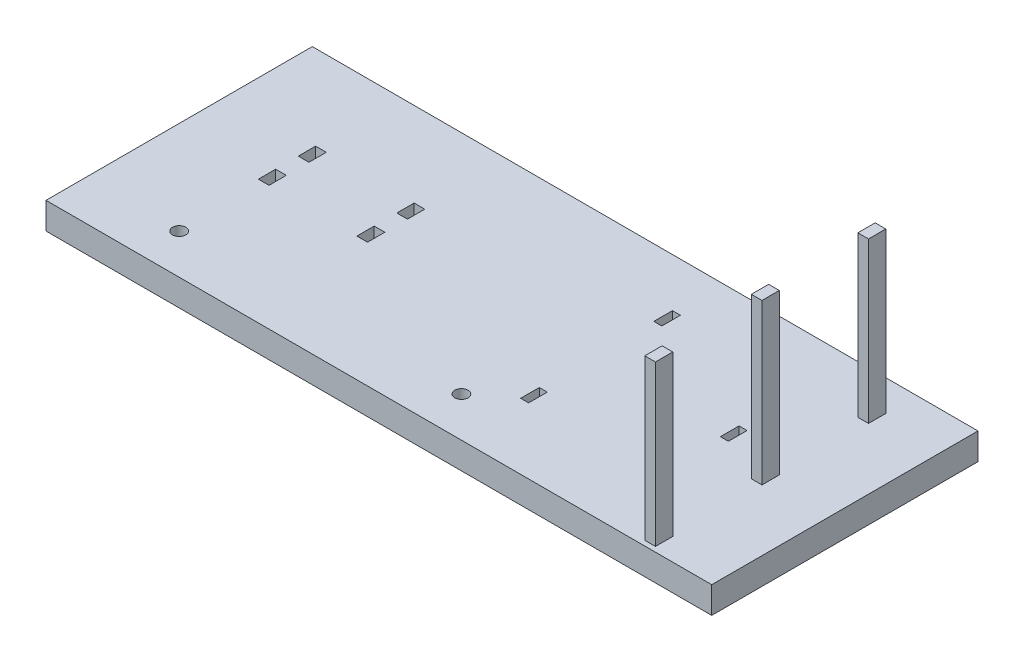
ISO-10303-21;
HEADER;
FILE_DESCRIPTION(('STEP AP214'),'2;1');
FILE_NAME('part.step','',(''),(''),'','','');
FILE_SCHEMA(('AUTOMOTIVE_DESIGN { 1 0 10303 214 1 1 1 1 }'));
ENDSEC;
DATA;
#1=APPLICATION_CONTEXT('core data for automotive mechanical design processes');
#2=APPLICATION_PROTOCOL_DEFINITION('international standard','automotive_design',2000,#1);
#3=PRODUCT_CONTEXT('',#1,'mechanical');
#4=PRODUCT('Part','Part','',(#3));
#5=PRODUCT_RELATED_PRODUCT_CATEGORY('part','',(#4));
#6=PRODUCT_DEFINITION_FORMATION('','',#4);
#7=PRODUCT_DEFINITION_CONTEXT('part definition',#1,'design');
#8=PRODUCT_DEFINITION('design','',#6,#7);
#9=PRODUCT_DEFINITION_SHAPE('','',#8);
#10=(LENGTH_UNIT() NAMED_UNIT(*) SI_UNIT(.MILLI.,.METRE.));
#11=(NAMED_UNIT(*) PLANE_ANGLE_UNIT() SI_UNIT($,.RADIAN.));
#12=(NAMED_UNIT(*) SI_UNIT($,.STERADIAN.) SOLID_ANGLE_UNIT());
#13=UNCERTAINTY_MEASURE_WITH_UNIT(LENGTH_MEASURE(1.E-05),#10,'distance_accuracy_value','');
#14=(GEOMETRIC_REPRESENTATION_CONTEXT(3) GLOBAL_UNCERTAINTY_ASSIGNED_CONTEXT((#13)) GLOBAL_UNIT_ASSIGNED_CONTEXT((#10,
#11,#12)) REPRESENTATION_CONTEXT('',''));
#15=CARTESIAN_POINT('',(0.,0.,0.));
#16=DIRECTION('',(0.,0.,1.));
#17=DIRECTION('',(1.,0.,0.));
#18=AXIS2_PLACEMENT_3D('',#15,#16,#17);
#19=CARTESIAN_POINT('',(0.,1.,0.));
#20=DIRECTION('',(0.,-1.,0.));
#21=DIRECTION('',(0.,0.,-1.));
#22=AXIS2_PLACEMENT_3D('',#19,#20,#21);
#23=PLANE('',#22);
#24=DIRECTION('',(0.,0.,-1.));
#25=VECTOR('',#24,1.);
#26=CARTESIAN_POINT('',(10.2,1.,0.162564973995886));
#27=LINE('',#26,#25);
#28=CARTESIAN_POINT('',(10.2,1.,0.812564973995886));
#29=VERTEX_POINT('',#28);
#30=CARTESIAN_POINT('',(10.2,1.,0.162564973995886));
#31=VERTEX_POINT('',#30);
#32=EDGE_CURVE('E335',#29,#31,#27,.T.);
#33=ORIENTED_EDGE('',*,*,#32,.F.);
#34=DIRECTION('',(1.,0.,0.));
#35=VECTOR('',#34,1.);
#36=CARTESIAN_POINT('',(9.80000000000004,1.,0.812564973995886));
#37=LINE('',#36,#35);
#38=CARTESIAN_POINT('',(9.80000000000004,1.,0.812564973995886));
#39=VERTEX_POINT('',#38);
#40=EDGE_CURVE('E348',#39,#29,#37,.T.);
#41=ORIENTED_EDGE('',*,*,#40,.F.);
#42=DIRECTION('',(0.,0.,1.));
#43=VECTOR('',#42,1.);
#44=CARTESIAN_POINT('',(9.80000000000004,1.,0.162564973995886));
#45=LINE('',#44,#43);
#46=CARTESIAN_POINT('',(9.80000000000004,1.,0.162564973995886));
#47=VERTEX_POINT('',#46);
#48=EDGE_CURVE('E357',#47,#39,#45,.T.);
#49=ORIENTED_EDGE('',*,*,#48,.F.);
#50=DIRECTION('',(-1.,0.,0.));
#51=VECTOR('',#50,1.);
#52=CARTESIAN_POINT('',(9.80000000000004,1.,0.162564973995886));
#53=LINE('',#52,#51);
#54=EDGE_CURVE('E338',#31,#47,#53,.T.);
#55=ORIENTED_EDGE('',*,*,#54,.F.);
#56=EDGE_LOOP('',(#33,#41,#49,#55));
#57=FACE_BOUND('',#56,.T.);
#58=DIRECTION('',(0.,0.,-1.));
#59=VECTOR('',#58,1.);
#60=CARTESIAN_POINT('',(12.5,1.,5.));
#61=LINE('',#60,#59);
#62=CARTESIAN_POINT('',(12.5,1.,5.));
#63=VERTEX_POINT('',#62);
#64=CARTESIAN_POINT('',(12.5,1.,-5.));
#65=VERTEX_POINT('',#64);
#66=EDGE_CURVE('E643',#63,#65,#61,.T.);
#67=ORIENTED_EDGE('',*,*,#66,.T.);
#68=DIRECTION('',(-1.,0.,0.));
#69=VECTOR('',#68,1.);
#70=CARTESIAN_POINT('',(-12.5,1.,-5.));
#71=LINE('',#70,#69);
#72=CARTESIAN_POINT('',(-12.5,1.,-5.));
#73=VERTEX_POINT('',#72);
#74=EDGE_CURVE('E646',#65,#73,#71,.T.);
#75=ORIENTED_EDGE('',*,*,#74,.T.);
#76=DIRECTION('',(0.,0.,1.));
#77=VECTOR('',#76,1.);
#78=CARTESIAN_POINT('',(-12.5,1.,5.));
#79=LINE('',#78,#77);
#80=CARTESIAN_POINT('',(-12.5,1.,5.));
#81=VERTEX_POINT('',#80);
#82=EDGE_CURVE('E649',#73,#81,#79,.T.);
#83=ORIENTED_EDGE('',*,*,#82,.T.);
#84=DIRECTION('',(1.,0.,0.));
#85=VECTOR('',#84,1.);
#86=CARTESIAN_POINT('',(-12.5,1.,5.));
#87=LINE('',#86,#85);
#88=EDGE_CURVE('E651',#81,#63,#87,.T.);
#89=ORIENTED_EDGE('',*,*,#88,.T.);
#90=EDGE_LOOP('',(#67,#75,#83,#89));
#91=FACE_BOUND('',#90,.T.);
#92=DIRECTION('',(1.,0.,0.));
#93=VECTOR('',#92,1.);
#94=CARTESIAN_POINT('',(-9.2,1.,-0.325));
#95=LINE('',#94,#93);
#96=CARTESIAN_POINT('',(-9.2,1.,-0.325));
#97=VERTEX_POINT('',#96);
#98=CARTESIAN_POINT('',(-8.8,1.,-0.325));
#99=VERTEX_POINT('',#98);
#100=EDGE_CURVE('E621',#97,#99,#95,.T.);
#101=ORIENTED_EDGE('',*,*,#100,.T.);
#102=DIRECTION('',(0.,0.,1.));
#103=VECTOR('',#102,1.);
#104=CARTESIAN_POINT('',(-8.8,1.,-0.325));
#105=LINE('',#104,#103);
#106=CARTESIAN_POINT('',(-8.8,1.,0.325));
#107=VERTEX_POINT('',#106);
#108=EDGE_CURVE('E611',#99,#107,#105,.T.);
#109=ORIENTED_EDGE('',*,*,#108,.T.);
#110=DIRECTION('',(-1.,0.,0.));
#111=VECTOR('',#110,1.);
#112=CARTESIAN_POINT('',(-9.2,1.,0.325));
#113=LINE('',#112,#111);
#114=CARTESIAN_POINT('',(-9.2,1.,0.325));
#115=VERTEX_POINT('',#114);
#116=EDGE_CURVE('E614',#107,#115,#113,.T.);
#117=ORIENTED_EDGE('',*,*,#116,.T.);
#118=DIRECTION('',(0.,0.,-1.));
#119=VECTOR('',#118,1.);
#120=CARTESIAN_POINT('',(-9.2,1.,-0.325));
#121=LINE('',#120,#119);
#122=EDGE_CURVE('E618',#115,#97,#121,.T.);
#123=ORIENTED_EDGE('',*,*,#122,.T.);
#124=EDGE_LOOP('',(#101,#109,#117,#123));
#125=FACE_BOUND('',#124,.T.);
#126=CARTESIAN_POINT('',(1.6,1.,3.5));
#127=DIRECTION('',(0.,-1.,0.));
#128=DIRECTION('',(0.,0.,-1.));
#129=AXIS2_PLACEMENT_3D('',#126,#127,#128);
#130=CIRCLE('',#129,0.25);
#131=CARTESIAN_POINT('',(1.6,1.,3.25));
#132=VERTEX_POINT('',#131);
#133=EDGE_CURVE('E446',#132,#132,#130,.T.);
#134=ORIENTED_EDGE('',*,*,#133,.T.);
#135=EDGE_LOOP('',(#134));
#136=FACE_BOUND('',#135,.T.);
#137=DIRECTION('',(1.,0.,0.));
#138=VECTOR('',#137,1.);
#139=CARTESIAN_POINT('',(7.85,1.,-0.675000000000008));
#140=LINE('',#139,#138);
#141=CARTESIAN_POINT('',(7.85,1.,-0.675000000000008));
#142=VERTEX_POINT('',#141);
#143=CARTESIAN_POINT('',(8.15,1.,-0.675000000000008));
#144=VERTEX_POINT('',#143);
#145=EDGE_CURVE('E591',#142,#144,#140,.T.);
#146=ORIENTED_EDGE('',*,*,#145,.T.);
#147=DIRECTION('',(0.,0.,1.));
#148=VECTOR('',#147,1.);
#149=CARTESIAN_POINT('',(8.15,1.,-0.675000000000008));
#150=LINE('',#149,#148);
#151=CARTESIAN_POINT('',(8.15,1.,0.0249999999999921));
#152=VERTEX_POINT('',#151);
#153=EDGE_CURVE('E581',#144,#152,#150,.T.);
#154=ORIENTED_EDGE('',*,*,#153,.T.);
#155=DIRECTION('',(-1.,0.,0.));
#156=VECTOR('',#155,1.);
#157=CARTESIAN_POINT('',(7.85,1.,0.0249999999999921));
#158=LINE('',#157,#156);
#159=CARTESIAN_POINT('',(7.85,1.,0.0249999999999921));
#160=VERTEX_POINT('',#159);
#161=EDGE_CURVE('E584',#152,#160,#158,.T.);
#162=ORIENTED_EDGE('',*,*,#161,.T.);
#163=DIRECTION('',(0.,0.,-1.));
#164=VECTOR('',#163,1.);
#165=CARTESIAN_POINT('',(7.85,1.,-0.675000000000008));
#166=LINE('',#165,#164);
#167=EDGE_CURVE('E588',#160,#142,#166,.T.);
#168=ORIENTED_EDGE('',*,*,#167,.T.);
#169=EDGE_LOOP('',(#146,#154,#162,#168));
#170=FACE_BOUND('',#169,.T.);
#171=DIRECTION('',(1.,0.,0.));
#172=VECTOR('',#171,1.);
#173=CARTESIAN_POINT('',(2.85,1.,1.825));
#174=LINE('',#173,#172);
#175=CARTESIAN_POINT('',(2.85,1.,1.825));
#176=VERTEX_POINT('',#175);
#177=CARTESIAN_POINT('',(3.15,1.,1.82499999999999));
#178=VERTEX_POINT('',#177);
#179=EDGE_CURVE('E521',#176,#178,#174,.T.);
#180=ORIENTED_EDGE('',*,*,#179,.T.);
#181=DIRECTION('',(0.,0.,1.));
#182=VECTOR('',#181,1.);
#183=CARTESIAN_POINT('',(3.15,1.,1.82499999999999));
#184=LINE('',#183,#182);
#185=CARTESIAN_POINT('',(3.15,1.,2.52499999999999));
#186=VERTEX_POINT('',#185);
#187=EDGE_CURVE('E511',#178,#186,#184,.T.);
#188=ORIENTED_EDGE('',*,*,#187,.T.);
#189=DIRECTION('',(-1.,0.,0.));
#190=VECTOR('',#189,1.);
#191=CARTESIAN_POINT('',(2.85,1.,2.52499999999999));
#192=LINE('',#191,#190);
#193=CARTESIAN_POINT('',(2.85,1.,2.52499999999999));
#194=VERTEX_POINT('',#193);
#195=EDGE_CURVE('E514',#186,#194,#192,.T.);
#196=ORIENTED_EDGE('',*,*,#195,.T.);
#197=DIRECTION('',(0.,0.,-1.));
#198=VECTOR('',#197,1.);
#199=CARTESIAN_POINT('',(2.85,1.,1.825));
#200=LINE('',#199,#198);
#201=EDGE_CURVE('E518',#194,#176,#200,.T.);
#202=ORIENTED_EDGE('',*,*,#201,.T.);
#203=EDGE_LOOP('',(#180,#188,#196,#202));
#204=FACE_BOUND('',#203,.T.);
#205=DIRECTION('',(1.,0.,0.));
#206=VECTOR('',#205,1.);
#207=CARTESIAN_POINT('',(2.85,1.,-3.175));
#208=LINE('',#207,#206);
#209=CARTESIAN_POINT('',(2.85,1.,-3.175));
#210=VERTEX_POINT('',#209);
#211=CARTESIAN_POINT('',(3.15,1.,-3.175));
#212=VERTEX_POINT('',#211);
#213=EDGE_CURVE('E555',#210,#212,#208,.T.);
#214=ORIENTED_EDGE('',*,*,#213,.T.);
#215=DIRECTION('',(0.,0.,1.));
#216=VECTOR('',#215,1.);
#217=CARTESIAN_POINT('',(3.15,1.,-2.475));
#218=LINE('',#217,#216);
#219=CARTESIAN_POINT('',(3.15,1.,-2.475));
#220=VERTEX_POINT('',#219);
#221=EDGE_CURVE('E545',#212,#220,#218,.T.);
#222=ORIENTED_EDGE('',*,*,#221,.T.);
#223=DIRECTION('',(-1.,0.,0.));
#224=VECTOR('',#223,1.);
#225=CARTESIAN_POINT('',(2.85,1.,-2.475));
#226=LINE('',#225,#224);
#227=CARTESIAN_POINT('',(2.85,1.,-2.475));
#228=VERTEX_POINT('',#227);
#229=EDGE_CURVE('E548',#220,#228,#226,.T.);
#230=ORIENTED_EDGE('',*,*,#229,.T.);
#231=DIRECTION('',(0.,0.,-1.));
#232=VECTOR('',#231,1.);
#233=CARTESIAN_POINT('',(2.85,1.,-2.475));
#234=LINE('',#233,#232);
#235=EDGE_CURVE('E552',#228,#210,#234,.T.);
#236=ORIENTED_EDGE('',*,*,#235,.T.);
#237=EDGE_LOOP('',(#214,#222,#230,#236));
#238=FACE_BOUND('',#237,.T.);
#239=DIRECTION('',(1.,0.,0.));
#240=VECTOR('',#239,1.);
#241=CARTESIAN_POINT('',(-9.2,1.,-1.825));
#242=LINE('',#241,#240);
#243=CARTESIAN_POINT('',(-9.2,1.,-1.825));
#244=VERTEX_POINT('',#243);
#245=CARTESIAN_POINT('',(-8.8,1.,-1.825));
#246=VERTEX_POINT('',#245);
#247=EDGE_CURVE('E457',#244,#246,#242,.T.);
#248=ORIENTED_EDGE('',*,*,#247,.T.);
#249=DIRECTION('',(0.,0.,1.));
#250=VECTOR('',#249,1.);
#251=CARTESIAN_POINT('',(-8.8,1.,-1.825));
#252=LINE('',#251,#250);
#253=CARTESIAN_POINT('',(-8.8,1.,-1.175));
#254=VERTEX_POINT('',#253);
#255=EDGE_CURVE('E447',#246,#254,#252,.T.);
#256=ORIENTED_EDGE('',*,*,#255,.T.);
#257=DIRECTION('',(-1.,0.,0.));
#258=VECTOR('',#257,1.);
#259=CARTESIAN_POINT('',(-9.2,1.,-1.175));
#260=LINE('',#259,#258);
#261=CARTESIAN_POINT('',(-9.2,1.,-1.175));
#262=VERTEX_POINT('',#261);
#263=EDGE_CURVE('E450',#254,#262,#260,.T.);
#264=ORIENTED_EDGE('',*,*,#263,.T.);
#265=DIRECTION('',(0.,0.,-1.));
#266=VECTOR('',#265,1.);
#267=CARTESIAN_POINT('',(-9.2,1.,-1.825));
#268=LINE('',#267,#266);
#269=EDGE_CURVE('E454',#262,#244,#268,.T.);
#270=ORIENTED_EDGE('',*,*,#269,.T.);
#271=EDGE_LOOP('',(#248,#256,#264,#270));
#272=FACE_BOUND('',#271,.T.);
#273=DIRECTION('',(1.,0.,0.));
#274=VECTOR('',#273,1.);
#275=CARTESIAN_POINT('',(-5.5,1.,-0.325));
#276=LINE('',#275,#274);
#277=CARTESIAN_POINT('',(-5.5,1.,-0.325));
#278=VERTEX_POINT('',#277);
#279=CARTESIAN_POINT('',(-5.1,1.,-0.325));
#280=VERTEX_POINT('',#279);
#281=EDGE_CURVE('E491',#278,#280,#276,.T.);
#282=ORIENTED_EDGE('',*,*,#281,.T.);
#283=DIRECTION('',(0.,0.,1.));
#284=VECTOR('',#283,1.);
#285=CARTESIAN_POINT('',(-5.1,1.,-0.325));
#286=LINE('',#285,#284);
#287=CARTESIAN_POINT('',(-5.1,1.,0.325));
#288=VERTEX_POINT('',#287);
#289=EDGE_CURVE('E481',#280,#288,#286,.T.);
#290=ORIENTED_EDGE('',*,*,#289,.T.);
#291=DIRECTION('',(-1.,0.,0.));
#292=VECTOR('',#291,1.);
#293=CARTESIAN_POINT('',(-5.5,1.,0.325));
#294=LINE('',#293,#292);
#295=CARTESIAN_POINT('',(-5.5,1.,0.325));
#296=VERTEX_POINT('',#295);
#297=EDGE_CURVE('E484',#288,#296,#294,.T.);
#298=ORIENTED_EDGE('',*,*,#297,.T.);
#299=DIRECTION('',(0.,0.,-1.));
#300=VECTOR('',#299,1.);
#301=CARTESIAN_POINT('',(-5.5,1.,-0.325));
#302=LINE('',#301,#300);
#303=EDGE_CURVE('E488',#296,#278,#302,.T.);
#304=ORIENTED_EDGE('',*,*,#303,.T.);
#305=EDGE_LOOP('',(#282,#290,#298,#304));
#306=FACE_BOUND('',#305,.T.);
#307=DIRECTION('',(1.,0.,0.));
#308=VECTOR('',#307,1.);
#309=CARTESIAN_POINT('',(-5.5,1.,-1.825));
#310=LINE('',#309,#308);
#311=CARTESIAN_POINT('',(-5.5,1.,-1.825));
#312=VERTEX_POINT('',#311);
#313=CARTESIAN_POINT('',(-5.1,1.,-1.825));
#314=VERTEX_POINT('',#313);
#315=EDGE_CURVE('E417',#312,#314,#310,.T.);
#316=ORIENTED_EDGE('',*,*,#315,.T.);
#317=DIRECTION('',(0.,0.,1.));
#318=VECTOR('',#317,1.);
#319=CARTESIAN_POINT('',(-5.1,1.,-1.825));
#320=LINE('',#319,#318);
#321=CARTESIAN_POINT('',(-5.1,1.,-1.175));
#322=VERTEX_POINT('',#321);
#323=EDGE_CURVE('E407',#314,#322,#320,.T.);
#324=ORIENTED_EDGE('',*,*,#323,.T.);
#325=DIRECTION('',(-1.,0.,0.));
#326=VECTOR('',#325,1.);
#327=CARTESIAN_POINT('',(-5.5,1.,-1.175));
#328=LINE('',#327,#326);
#329=CARTESIAN_POINT('',(-5.5,1.,-1.175));
#330=VERTEX_POINT('',#329);
#331=EDGE_CURVE('E410',#322,#330,#328,.T.);
#332=ORIENTED_EDGE('',*,*,#331,.T.);
#333=DIRECTION('',(0.,0.,-1.));
#334=VECTOR('',#333,1.);
#335=CARTESIAN_POINT('',(-5.5,1.,-1.825));
#336=LINE('',#335,#334);
#337=EDGE_CURVE('E414',#330,#312,#336,.T.);
#338=ORIENTED_EDGE('',*,*,#337,.T.);
#339=EDGE_LOOP('',(#316,#324,#332,#338));
#340=FACE_BOUND('',#339,.T.);
#341=CARTESIAN_POINT('',(-9.,1.,3.5));
#342=DIRECTION('',(0.,-1.,0.));
#343=DIRECTION('',(0.,0.,-1.));
#344=AXIS2_PLACEMENT_3D('',#341,#342,#343);
#345=CIRCLE('',#344,0.25);
#346=CARTESIAN_POINT('',(-9.,1.,3.25));
#347=VERTEX_POINT('',#346);
#348=EDGE_CURVE('E424',#347,#347,#345,.T.);
#349=ORIENTED_EDGE('',*,*,#348,.T.);
#350=EDGE_LOOP('',(#349));
#351=FACE_BOUND('',#350,.T.);
#352=DIRECTION('',(0.,0.,-1.));
#353=VECTOR('',#352,1.);
#354=CARTESIAN_POINT('',(10.2,1.,-3.83743502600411));
#355=LINE('',#354,#353);
#356=CARTESIAN_POINT('',(10.2,1.,-3.18743502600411));
#357=VERTEX_POINT('',#356);
#358=CARTESIAN_POINT('',(10.2,1.,-3.83743502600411));
#359=VERTEX_POINT('',#358);
#360=EDGE_CURVE('E373',#357,#359,#355,.T.);
#361=ORIENTED_EDGE('',*,*,#360,.F.);
#362=DIRECTION('',(1.,0.,0.));
#363=VECTOR('',#362,1.);
#364=CARTESIAN_POINT('',(9.8,1.,-3.18743502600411));
#365=LINE('',#364,#363);
#366=CARTESIAN_POINT('',(9.8,1.,-3.18743502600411));
#367=VERTEX_POINT('',#366);
#368=EDGE_CURVE('E378',#367,#357,#365,.T.);
#369=ORIENTED_EDGE('',*,*,#368,.F.);
#370=DIRECTION('',(0.,0.,1.));
#371=VECTOR('',#370,1.);
#372=CARTESIAN_POINT('',(9.8,1.,-3.83743502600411));
#373=LINE('',#372,#371);
#374=CARTESIAN_POINT('',(9.8,1.,-3.83743502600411));
#375=VERTEX_POINT('',#374);
#376=EDGE_CURVE('E390',#375,#367,#373,.T.);
#377=ORIENTED_EDGE('',*,*,#376,.F.);
#378=DIRECTION('',(-1.,0.,0.));
#379=VECTOR('',#378,1.);
#380=CARTESIAN_POINT('',(9.8,1.,-3.83743502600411));
#381=LINE('',#380,#379);
#382=EDGE_CURVE('E387',#359,#375,#381,.T.);
#383=ORIENTED_EDGE('',*,*,#382,.F.);
#384=EDGE_LOOP('',(#361,#369,#377,#383));
#385=FACE_BOUND('',#384,.T.);
#386=DIRECTION('',(0.,0.,-1.));
#387=VECTOR('',#386,1.);
#388=CARTESIAN_POINT('',(10.2000000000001,1.,4.16256497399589));
#389=LINE('',#388,#387);
#390=CARTESIAN_POINT('',(10.2000000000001,1.,4.81256497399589));
#391=VERTEX_POINT('',#390);
#392=CARTESIAN_POINT('',(10.2000000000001,1.,4.16256497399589));
#393=VERTEX_POINT('',#392);
#394=EDGE_CURVE('E334',#391,#393,#389,.T.);
#395=ORIENTED_EDGE('',*,*,#394,.F.);
#396=DIRECTION('',(1.,0.,0.));
#397=VECTOR('',#396,1.);
#398=CARTESIAN_POINT('',(9.80000000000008,1.,4.81256497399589));
#399=LINE('',#398,#397);
#400=CARTESIAN_POINT('',(9.80000000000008,1.,4.81256497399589));
#401=VERTEX_POINT('',#400);
#402=EDGE_CURVE('E331',#401,#391,#399,.T.);
#403=ORIENTED_EDGE('',*,*,#402,.F.);
#404=DIRECTION('',(0.,0.,1.));
#405=VECTOR('',#404,1.);
#406=CARTESIAN_POINT('',(9.80000000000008,1.,4.16256497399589));
#407=LINE('',#406,#405);
#408=CARTESIAN_POINT('',(9.80000000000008,1.,4.16256497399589));
#409=VERTEX_POINT('',#408);
#410=EDGE_CURVE('E53',#409,#401,#407,.T.);
#411=ORIENTED_EDGE('',*,*,#410,.F.);
#412=DIRECTION('',(-1.,0.,0.));
#413=VECTOR('',#412,1.);
#414=CARTESIAN_POINT('',(9.80000000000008,1.,4.16256497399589));
#415=LINE('',#414,#413);
#416=EDGE_CURVE('E48',#393,#409,#415,.T.);
#417=ORIENTED_EDGE('',*,*,#416,.F.);
#418=EDGE_LOOP('',(#395,#403,#411,#417));
#419=FACE_BOUND('',#418,.T.);
#420=ADVANCED_FACE('F33',(#57,#91,#125,#136,#170,#204,#238,#272,#306,#340,#351,#385,#419),#23,.F.);
#421=CARTESIAN_POINT('',(12.5,1.,5.));
#422=DIRECTION('',(-1.,0.,0.));
#423=DIRECTION('',(0.,0.,1.));
#424=AXIS2_PLACEMENT_3D('',#421,#422,#423);
#425=PLANE('',#424);
#426=DIRECTION('',(0.,0.,-1.));
#427=VECTOR('',#426,1.);
#428=CARTESIAN_POINT('',(12.5,0.,5.));
#429=LINE('',#428,#427);
#430=CARTESIAN_POINT('',(12.5,0.,5.));
#431=VERTEX_POINT('',#430);
#432=CARTESIAN_POINT('',(12.5,0.,-5.));
#433=VERTEX_POINT('',#432);
#434=EDGE_CURVE('E636',#431,#433,#429,.T.);
#435=ORIENTED_EDGE('',*,*,#434,.T.);
#436=DIRECTION('',(0.,-1.,0.));
#437=VECTOR('',#436,1.);
#438=CARTESIAN_POINT('',(12.5,1.,-5.));
#439=LINE('',#438,#437);
#440=EDGE_CURVE('E11',#65,#433,#439,.T.);
#441=ORIENTED_EDGE('',*,*,#440,.F.);
#442=ORIENTED_EDGE('',*,*,#66,.F.);
#443=DIRECTION('',(0.,-1.,0.));
#444=VECTOR('',#443,1.);
#445=CARTESIAN_POINT('',(12.5,1.,5.));
#446=LINE('',#445,#444);
#447=EDGE_CURVE('E653',#63,#431,#446,.T.);
#448=ORIENTED_EDGE('',*,*,#447,.T.);
#449=EDGE_LOOP('',(#435,#441,#442,#448));
#450=FACE_BOUND('',#449,.T.);
#451=ADVANCED_FACE('F35',(#450),#425,.F.);
#452=CARTESIAN_POINT('',(-12.5,1.,-5.));
#453=DIRECTION('',(0.,0.,1.));
#454=DIRECTION('',(1.,0.,0.));
#455=AXIS2_PLACEMENT_3D('',#452,#453,#454);
#456=PLANE('',#455);
#457=DIRECTION('',(-1.,0.,0.));
#458=VECTOR('',#457,1.);
#459=CARTESIAN_POINT('',(-12.5,0.,-5.));
#460=LINE('',#459,#458);
#461=CARTESIAN_POINT('',(-12.5,0.,-5.));
#462=VERTEX_POINT('',#461);
#463=EDGE_CURVE('E656',#433,#462,#460,.T.);
#464=ORIENTED_EDGE('',*,*,#463,.T.);
#465=DIRECTION('',(0.,-1.,0.));
#466=VECTOR('',#465,1.);
#467=CARTESIAN_POINT('',(-12.5,1.,-5.));
#468=LINE('',#467,#466);
#469=EDGE_CURVE('E41',#73,#462,#468,.T.);
#470=ORIENTED_EDGE('',*,*,#469,.F.);
#471=ORIENTED_EDGE('',*,*,#74,.F.);
#472=ORIENTED_EDGE('',*,*,#440,.T.);
#473=EDGE_LOOP('',(#464,#470,#471,#472));
#474=FACE_BOUND('',#473,.T.);
#475=ADVANCED_FACE('F686',(#474),#456,.F.);
#476=CARTESIAN_POINT('',(-12.5,1.,5.));
#477=DIRECTION('',(1.,0.,0.));
#478=DIRECTION('',(0.,0.,-1.));
#479=AXIS2_PLACEMENT_3D('',#476,#477,#478);
#480=PLANE('',#479);
#481=DIRECTION('',(0.,0.,1.));
#482=VECTOR('',#481,1.);
#483=CARTESIAN_POINT('',(-12.5,0.,5.));
#484=LINE('',#483,#482);
#485=CARTESIAN_POINT('',(-12.5,0.,5.));
#486=VERTEX_POINT('',#485);
#487=EDGE_CURVE('E658',#462,#486,#484,.T.);
#488=ORIENTED_EDGE('',*,*,#487,.T.);
#489=DIRECTION('',(0.,-1.,0.));
#490=VECTOR('',#489,1.);
#491=CARTESIAN_POINT('',(-12.5,1.,5.));
#492=LINE('',#491,#490);
#493=EDGE_CURVE('E663',#81,#486,#492,.T.);
#494=ORIENTED_EDGE('',*,*,#493,.F.);
#495=ORIENTED_EDGE('',*,*,#82,.F.);
#496=ORIENTED_EDGE('',*,*,#469,.T.);
#497=EDGE_LOOP('',(#488,#494,#495,#496));
#498=FACE_BOUND('',#497,.T.);
#499=ADVANCED_FACE('F670',(#498),#480,.F.);
#500=CARTESIAN_POINT('',(-12.5,1.,5.));
#501=DIRECTION('',(0.,0.,-1.));
#502=DIRECTION('',(-1.,0.,0.));
#503=AXIS2_PLACEMENT_3D('',#500,#501,#502);
#504=PLANE('',#503);
#505=DIRECTION('',(1.,0.,0.));
#506=VECTOR('',#505,1.);
#507=CARTESIAN_POINT('',(-12.5,0.,5.));
#508=LINE('',#507,#506);
#509=EDGE_CURVE('E647',#486,#431,#508,.T.);
#510=ORIENTED_EDGE('',*,*,#509,.T.);
#511=ORIENTED_EDGE('',*,*,#447,.F.);
#512=ORIENTED_EDGE('',*,*,#88,.F.);
#513=ORIENTED_EDGE('',*,*,#493,.T.);
#514=EDGE_LOOP('',(#510,#511,#512,#513));
#515=FACE_BOUND('',#514,.T.);
#516=ADVANCED_FACE('F679',(#515),#504,.F.);
#517=CARTESIAN_POINT('',(0.,0.,0.));
#518=DIRECTION('',(0.,-1.,0.));
#519=DIRECTION('',(0.,0.,-1.));
#520=AXIS2_PLACEMENT_3D('',#517,#518,#519);
#521=PLANE('',#520);
#522=CARTESIAN_POINT('',(-9.,0.,3.5));
#523=DIRECTION('',(0.,-1.,0.));
#524=DIRECTION('',(0.,0.,-1.));
#525=AXIS2_PLACEMENT_3D('',#522,#523,#524);
#526=CIRCLE('',#525,0.25);
#527=CARTESIAN_POINT('',(-9.,0.,3.25));
#528=VERTEX_POINT('',#527);
#529=EDGE_CURVE('E443',#528,#528,#526,.T.);
#530=ORIENTED_EDGE('',*,*,#529,.F.);
#531=EDGE_LOOP('',(#530));
#532=FACE_BOUND('',#531,.T.);
#533=DIRECTION('',(0.,0.,1.));
#534=VECTOR('',#533,1.);
#535=CARTESIAN_POINT('',(-5.1,0.,-1.825));
#536=LINE('',#535,#534);
#537=CARTESIAN_POINT('',(-5.1,0.,-1.825));
#538=VERTEX_POINT('',#537);
#539=CARTESIAN_POINT('',(-5.1,0.,-1.175));
#540=VERTEX_POINT('',#539);
#541=EDGE_CURVE('E421',#538,#540,#536,.T.);
#542=ORIENTED_EDGE('',*,*,#541,.F.);
#543=DIRECTION('',(1.,0.,0.));
#544=VECTOR('',#543,1.);
#545=CARTESIAN_POINT('',(-5.5,0.,-1.825));
#546=LINE('',#545,#544);
#547=CARTESIAN_POINT('',(-5.5,0.,-1.825));
#548=VERTEX_POINT('',#547);
#549=EDGE_CURVE('E411',#548,#538,#546,.T.);
#550=ORIENTED_EDGE('',*,*,#549,.F.);
#551=DIRECTION('',(0.,0.,-1.));
#552=VECTOR('',#551,1.);
#553=CARTESIAN_POINT('',(-5.5,0.,-1.825));
#554=LINE('',#553,#552);
#555=CARTESIAN_POINT('',(-5.5,0.,-1.175));
#556=VERTEX_POINT('',#555);
#557=EDGE_CURVE('E427',#556,#548,#554,.T.);
#558=ORIENTED_EDGE('',*,*,#557,.F.);
#559=DIRECTION('',(-1.,0.,0.));
#560=VECTOR('',#559,1.);
#561=CARTESIAN_POINT('',(-5.5,0.,-1.175));
#562=LINE('',#561,#560);
#563=EDGE_CURVE('E423',#540,#556,#562,.T.);
#564=ORIENTED_EDGE('',*,*,#563,.F.);
#565=EDGE_LOOP('',(#542,#550,#558,#564));
#566=FACE_BOUND('',#565,.T.);
#567=DIRECTION('',(0.,0.,1.));
#568=VECTOR('',#567,1.);
#569=CARTESIAN_POINT('',(-5.1,0.,-0.325));
#570=LINE('',#569,#568);
#571=CARTESIAN_POINT('',(-5.1,0.,-0.325));
#572=VERTEX_POINT('',#571);
#573=CARTESIAN_POINT('',(-5.1,0.,0.325));
#574=VERTEX_POINT('',#573);
#575=EDGE_CURVE('E434',#572,#574,#570,.T.);
#576=ORIENTED_EDGE('',*,*,#575,.F.);
#577=DIRECTION('',(1.,0.,0.));
#578=VECTOR('',#577,1.);
#579=CARTESIAN_POINT('',(-5.5,0.,-0.325));
#580=LINE('',#579,#578);
#581=CARTESIAN_POINT('',(-5.5,0.,-0.325));
#582=VERTEX_POINT('',#581);
#583=EDGE_CURVE('E485',#582,#572,#580,.T.);
#584=ORIENTED_EDGE('',*,*,#583,.F.);
#585=DIRECTION('',(0.,0.,-1.));
#586=VECTOR('',#585,1.);
#587=CARTESIAN_POINT('',(-5.5,0.,-0.325));
#588=LINE('',#587,#586);
#589=CARTESIAN_POINT('',(-5.5,0.,0.325));
#590=VERTEX_POINT('',#589);
#591=EDGE_CURVE('E499',#590,#582,#588,.T.);
#592=ORIENTED_EDGE('',*,*,#591,.F.);
#593=DIRECTION('',(-1.,0.,0.));
#594=VECTOR('',#593,1.);
#595=CARTESIAN_POINT('',(-5.5,0.,0.325));
#596=LINE('',#595,#594);
#597=EDGE_CURVE('E496',#574,#590,#596,.T.);
#598=ORIENTED_EDGE('',*,*,#597,.F.);
#599=EDGE_LOOP('',(#576,#584,#592,#598));
#600=FACE_BOUND('',#599,.T.);
#601=DIRECTION('',(0.,0.,1.));
#602=VECTOR('',#601,1.);
#603=CARTESIAN_POINT('',(-8.8,0.,-1.825));
#604=LINE('',#603,#602);
#605=CARTESIAN_POINT('',(-8.8,0.,-1.825));
#606=VERTEX_POINT('',#605);
#607=CARTESIAN_POINT('',(-8.8,0.,-1.175));
#608=VERTEX_POINT('',#607);
#609=EDGE_CURVE('E461',#606,#608,#604,.T.);
#610=ORIENTED_EDGE('',*,*,#609,.F.);
#611=DIRECTION('',(1.,0.,0.));
#612=VECTOR('',#611,1.);
#613=CARTESIAN_POINT('',(-9.2,0.,-1.825));
#614=LINE('',#613,#612);
#615=CARTESIAN_POINT('',(-9.2,0.,-1.825));
#616=VERTEX_POINT('',#615);
#617=EDGE_CURVE('E451',#616,#606,#614,.T.);
#618=ORIENTED_EDGE('',*,*,#617,.F.);
#619=DIRECTION('',(0.,0.,-1.));
#620=VECTOR('',#619,1.);
#621=CARTESIAN_POINT('',(-9.2,0.,-1.825));
#622=LINE('',#621,#620);
#623=CARTESIAN_POINT('',(-9.2,0.,-1.175));
#624=VERTEX_POINT('',#623);
#625=EDGE_CURVE('E467',#624,#616,#622,.T.);
#626=ORIENTED_EDGE('',*,*,#625,.F.);
#627=DIRECTION('',(-1.,0.,0.));
#628=VECTOR('',#627,1.);
#629=CARTESIAN_POINT('',(-9.2,0.,-1.175));
#630=LINE('',#629,#628);
#631=EDGE_CURVE('E463',#608,#624,#630,.T.);
#632=ORIENTED_EDGE('',*,*,#631,.F.);
#633=EDGE_LOOP('',(#610,#618,#626,#632));
#634=FACE_BOUND('',#633,.T.);
#635=DIRECTION('',(0.,0.,1.));
#636=VECTOR('',#635,1.);
#637=CARTESIAN_POINT('',(3.15,0.,-2.475));
#638=LINE('',#637,#636);
#639=CARTESIAN_POINT('',(3.15,0.,-3.175));
#640=VERTEX_POINT('',#639);
#641=CARTESIAN_POINT('',(3.15,0.,-2.475));
#642=VERTEX_POINT('',#641);
#643=EDGE_CURVE('E406',#640,#642,#638,.T.);
#644=ORIENTED_EDGE('',*,*,#643,.F.);
#645=DIRECTION('',(1.,0.,0.));
#646=VECTOR('',#645,1.);
#647=CARTESIAN_POINT('',(2.85,0.,-3.175));
#648=LINE('',#647,#646);
#649=CARTESIAN_POINT('',(2.85,0.,-3.175));
#650=VERTEX_POINT('',#649);
#651=EDGE_CURVE('E549',#650,#640,#648,.T.);
#652=ORIENTED_EDGE('',*,*,#651,.F.);
#653=DIRECTION('',(0.,0.,-1.));
#654=VECTOR('',#653,1.);
#655=CARTESIAN_POINT('',(2.85,0.,-2.475));
#656=LINE('',#655,#654);
#657=CARTESIAN_POINT('',(2.85,0.,-2.475));
#658=VERTEX_POINT('',#657);
#659=EDGE_CURVE('E563',#658,#650,#656,.T.);
#660=ORIENTED_EDGE('',*,*,#659,.F.);
#661=DIRECTION('',(-1.,0.,0.));
#662=VECTOR('',#661,1.);
#663=CARTESIAN_POINT('',(2.85,0.,-2.475));
#664=LINE('',#663,#662);
#665=EDGE_CURVE('E560',#642,#658,#664,.T.);
#666=ORIENTED_EDGE('',*,*,#665,.F.);
#667=EDGE_LOOP('',(#644,#652,#660,#666));
#668=FACE_BOUND('',#667,.T.);
#669=DIRECTION('',(0.,0.,1.));
#670=VECTOR('',#669,1.);
#671=CARTESIAN_POINT('',(3.15,0.,1.82499999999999));
#672=LINE('',#671,#670);
#673=CARTESIAN_POINT('',(3.15,0.,1.82499999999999));
#674=VERTEX_POINT('',#673);
#675=CARTESIAN_POINT('',(3.15,0.,2.52499999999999));
#676=VERTEX_POINT('',#675);
#677=EDGE_CURVE('E525',#674,#676,#672,.T.);
#678=ORIENTED_EDGE('',*,*,#677,.F.);
#679=DIRECTION('',(1.,0.,0.));
#680=VECTOR('',#679,1.);
#681=CARTESIAN_POINT('',(2.85,0.,1.825));
#682=LINE('',#681,#680);
#683=CARTESIAN_POINT('',(2.85,0.,1.825));
#684=VERTEX_POINT('',#683);
#685=EDGE_CURVE('E515',#684,#674,#682,.T.);
#686=ORIENTED_EDGE('',*,*,#685,.F.);
#687=DIRECTION('',(0.,0.,-1.));
#688=VECTOR('',#687,1.);
#689=CARTESIAN_POINT('',(2.85,0.,1.825));
#690=LINE('',#689,#688);
#691=CARTESIAN_POINT('',(2.85,0.,2.52499999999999));
#692=VERTEX_POINT('',#691);
#693=EDGE_CURVE('E531',#692,#684,#690,.T.);
#694=ORIENTED_EDGE('',*,*,#693,.F.);
#695=DIRECTION('',(-1.,0.,0.));
#696=VECTOR('',#695,1.);
#697=CARTESIAN_POINT('',(2.85,0.,2.52499999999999));
#698=LINE('',#697,#696);
#699=EDGE_CURVE('E527',#676,#692,#698,.T.);
#700=ORIENTED_EDGE('',*,*,#699,.F.);
#701=EDGE_LOOP('',(#678,#686,#694,#700));
#702=FACE_BOUND('',#701,.T.);
#703=DIRECTION('',(0.,0.,1.));
#704=VECTOR('',#703,1.);
#705=CARTESIAN_POINT('',(8.15,0.,-0.675000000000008));
#706=LINE('',#705,#704);
#707=CARTESIAN_POINT('',(8.15,0.,-0.675000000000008));
#708=VERTEX_POINT('',#707);
#709=CARTESIAN_POINT('',(8.15,0.,0.0249999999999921));
#710=VERTEX_POINT('',#709);
#711=EDGE_CURVE('E538',#708,#710,#706,.T.);
#712=ORIENTED_EDGE('',*,*,#711,.F.);
#713=DIRECTION('',(1.,0.,0.));
#714=VECTOR('',#713,1.);
#715=CARTESIAN_POINT('',(7.85,0.,-0.675000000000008));
#716=LINE('',#715,#714);
#717=CARTESIAN_POINT('',(7.85,0.,-0.675000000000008));
#718=VERTEX_POINT('',#717);
#719=EDGE_CURVE('E585',#718,#708,#716,.T.);
#720=ORIENTED_EDGE('',*,*,#719,.F.);
#721=DIRECTION('',(0.,0.,-1.));
#722=VECTOR('',#721,1.);
#723=CARTESIAN_POINT('',(7.85,0.,-0.675000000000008));
#724=LINE('',#723,#722);
#725=CARTESIAN_POINT('',(7.85,0.,0.0249999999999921));
#726=VERTEX_POINT('',#725);
#727=EDGE_CURVE('E599',#726,#718,#724,.T.);
#728=ORIENTED_EDGE('',*,*,#727,.F.);
#729=DIRECTION('',(-1.,0.,0.));
#730=VECTOR('',#729,1.);
#731=CARTESIAN_POINT('',(7.85,0.,0.0249999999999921));
#732=LINE('',#731,#730);
#733=EDGE_CURVE('E596',#710,#726,#732,.T.);
#734=ORIENTED_EDGE('',*,*,#733,.F.);
#735=EDGE_LOOP('',(#712,#720,#728,#734));
#736=FACE_BOUND('',#735,.T.);
#737=CARTESIAN_POINT('',(1.6,0.,3.5));
#738=DIRECTION('',(0.,-1.,0.));
#739=DIRECTION('',(0.,0.,-1.));
#740=AXIS2_PLACEMENT_3D('',#737,#738,#739);
#741=CIRCLE('',#740,0.25);
#742=CARTESIAN_POINT('',(1.6,0.,3.25));
#743=VERTEX_POINT('',#742);
#744=EDGE_CURVE('E577',#743,#743,#741,.T.);
#745=ORIENTED_EDGE('',*,*,#744,.F.);
#746=EDGE_LOOP('',(#745));
#747=FACE_BOUND('',#746,.T.);
#748=DIRECTION('',(0.,0.,1.));
#749=VECTOR('',#748,1.);
#750=CARTESIAN_POINT('',(-8.8,0.,-0.325));
#751=LINE('',#750,#749);
#752=CARTESIAN_POINT('',(-8.8,0.,-0.325));
#753=VERTEX_POINT('',#752);
#754=CARTESIAN_POINT('',(-8.8,0.,0.325));
#755=VERTEX_POINT('',#754);
#756=EDGE_CURVE('E474',#753,#755,#751,.T.);
#757=ORIENTED_EDGE('',*,*,#756,.F.);
#758=DIRECTION('',(1.,0.,0.));
#759=VECTOR('',#758,1.);
#760=CARTESIAN_POINT('',(-9.2,0.,-0.325));
#761=LINE('',#760,#759);
#762=CARTESIAN_POINT('',(-9.2,0.,-0.325));
#763=VERTEX_POINT('',#762);
#764=EDGE_CURVE('E615',#763,#753,#761,.T.);
#765=ORIENTED_EDGE('',*,*,#764,.F.);
#766=DIRECTION('',(0.,0.,-1.));
#767=VECTOR('',#766,1.);
#768=CARTESIAN_POINT('',(-9.2,0.,-0.325));
#769=LINE('',#768,#767);
#770=CARTESIAN_POINT('',(-9.2,0.,0.325));
#771=VERTEX_POINT('',#770);
#772=EDGE_CURVE('E629',#771,#763,#769,.T.);
#773=ORIENTED_EDGE('',*,*,#772,.F.);
#774=DIRECTION('',(-1.,0.,0.));
#775=VECTOR('',#774,1.);
#776=CARTESIAN_POINT('',(-9.2,0.,0.325));
#777=LINE('',#776,#775);
#778=EDGE_CURVE('E626',#755,#771,#777,.T.);
#779=ORIENTED_EDGE('',*,*,#778,.F.);
#780=EDGE_LOOP('',(#757,#765,#773,#779));
#781=FACE_BOUND('',#780,.T.);
#782=ORIENTED_EDGE('',*,*,#434,.F.);
#783=ORIENTED_EDGE('',*,*,#509,.F.);
#784=ORIENTED_EDGE('',*,*,#487,.F.);
#785=ORIENTED_EDGE('',*,*,#463,.F.);
#786=EDGE_LOOP('',(#782,#783,#784,#785));
#787=FACE_BOUND('',#786,.T.);
#788=ADVANCED_FACE('F676',(#532,#566,#600,#634,#668,#702,#736,#747,#781,#787),#521,.T.);
#789=CARTESIAN_POINT('',(-8.8,1.,-0.325));
#790=DIRECTION('',(1.,0.,0.));
#791=DIRECTION('',(0.,0.,-1.));
#792=AXIS2_PLACEMENT_3D('',#789,#790,#791);
#793=PLANE('',#792);
#794=ORIENTED_EDGE('',*,*,#756,.T.);
#795=DIRECTION('',(0.,-1.,0.));
#796=VECTOR('',#795,1.);
#797=CARTESIAN_POINT('',(-8.8,1.,0.325));
#798=LINE('',#797,#796);
#799=EDGE_CURVE('E624',#107,#755,#798,.T.);
#800=ORIENTED_EDGE('',*,*,#799,.F.);
#801=ORIENTED_EDGE('',*,*,#108,.F.);
#802=DIRECTION('',(0.,-1.,0.));
#803=VECTOR('',#802,1.);
#804=CARTESIAN_POINT('',(-8.8,1.,-0.325));
#805=LINE('',#804,#803);
#806=EDGE_CURVE('E634',#99,#753,#805,.T.);
#807=ORIENTED_EDGE('',*,*,#806,.T.);
#808=EDGE_LOOP('',(#794,#800,#801,#807));
#809=FACE_BOUND('',#808,.T.);
#810=ADVANCED_FACE('F700',(#809),#793,.F.);
#811=CARTESIAN_POINT('',(-9.2,1.,-0.325));
#812=DIRECTION('',(0.,0.,-1.));
#813=DIRECTION('',(-1.,0.,0.));
#814=AXIS2_PLACEMENT_3D('',#811,#812,#813);
#815=PLANE('',#814);
#816=ORIENTED_EDGE('',*,*,#764,.T.);
#817=ORIENTED_EDGE('',*,*,#806,.F.);
#818=ORIENTED_EDGE('',*,*,#100,.F.);
#819=DIRECTION('',(0.,-1.,0.));
#820=VECTOR('',#819,1.);
#821=CARTESIAN_POINT('',(-9.2,1.,-0.325));
#822=LINE('',#821,#820);
#823=EDGE_CURVE('E637',#97,#763,#822,.T.);
#824=ORIENTED_EDGE('',*,*,#823,.T.);
#825=EDGE_LOOP('',(#816,#817,#818,#824));
#826=FACE_BOUND('',#825,.T.);
#827=ADVANCED_FACE('F720',(#826),#815,.F.);
#828=CARTESIAN_POINT('',(-9.2,1.,-0.325));
#829=DIRECTION('',(-1.,0.,0.));
#830=DIRECTION('',(0.,0.,1.));
#831=AXIS2_PLACEMENT_3D('',#828,#829,#830);
#832=PLANE('',#831);
#833=ORIENTED_EDGE('',*,*,#772,.T.);
#834=ORIENTED_EDGE('',*,*,#823,.F.);
#835=ORIENTED_EDGE('',*,*,#122,.F.);
#836=DIRECTION('',(0.,-1.,0.));
#837=VECTOR('',#836,1.);
#838=CARTESIAN_POINT('',(-9.2,1.,0.325));
#839=LINE('',#838,#837);
#840=EDGE_CURVE('E639',#115,#771,#839,.T.);
#841=ORIENTED_EDGE('',*,*,#840,.T.);
#842=EDGE_LOOP('',(#833,#834,#835,#841));
#843=FACE_BOUND('',#842,.T.);
#844=ADVANCED_FACE('F727',(#843),#832,.F.);
#845=CARTESIAN_POINT('',(-9.2,1.,0.325));
#846=DIRECTION('',(0.,0.,1.));
#847=DIRECTION('',(1.,0.,0.));
#848=AXIS2_PLACEMENT_3D('',#845,#846,#847);
#849=PLANE('',#848);
#850=ORIENTED_EDGE('',*,*,#778,.T.);
#851=ORIENTED_EDGE('',*,*,#840,.F.);
#852=ORIENTED_EDGE('',*,*,#116,.F.);
#853=ORIENTED_EDGE('',*,*,#799,.T.);
#854=EDGE_LOOP('',(#850,#851,#852,#853));
#855=FACE_BOUND('',#854,.T.);
#856=ADVANCED_FACE('F735',(#855),#849,.F.);
#857=CARTESIAN_POINT('',(1.6,1.,3.5));
#858=DIRECTION('',(0.,-1.,0.));
#859=DIRECTION('',(0.,0.,-1.));
#860=AXIS2_PLACEMENT_3D('',#857,#858,#859);
#861=CYLINDRICAL_SURFACE('',#860,0.25);
#862=ORIENTED_EDGE('',*,*,#133,.F.);
#863=EDGE_LOOP('',(#862));
#864=FACE_BOUND('',#863,.T.);
#865=ORIENTED_EDGE('',*,*,#744,.T.);
#866=EDGE_LOOP('',(#865));
#867=FACE_BOUND('',#866,.T.);
#868=ADVANCED_FACE('F743',(#864,#867),#861,.F.);
#869=CARTESIAN_POINT('',(8.15,1.,-0.675000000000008));
#870=DIRECTION('',(1.,0.,0.));
#871=DIRECTION('',(0.,0.,-1.));
#872=AXIS2_PLACEMENT_3D('',#869,#870,#871);
#873=PLANE('',#872);
#874=ORIENTED_EDGE('',*,*,#711,.T.);
#875=DIRECTION('',(0.,-1.,0.));
#876=VECTOR('',#875,1.);
#877=CARTESIAN_POINT('',(8.15,1.,0.0249999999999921));
#878=LINE('',#877,#876);
#879=EDGE_CURVE('E594',#152,#710,#878,.T.);
#880=ORIENTED_EDGE('',*,*,#879,.F.);
#881=ORIENTED_EDGE('',*,*,#153,.F.);
#882=DIRECTION('',(0.,-1.,0.));
#883=VECTOR('',#882,1.);
#884=CARTESIAN_POINT('',(8.15,1.,-0.675000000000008));
#885=LINE('',#884,#883);
#886=EDGE_CURVE('E580',#144,#708,#885,.T.);
#887=ORIENTED_EDGE('',*,*,#886,.T.);
#888=EDGE_LOOP('',(#874,#880,#881,#887));
#889=FACE_BOUND('',#888,.T.);
#890=ADVANCED_FACE('F750',(#889),#873,.F.);
#891=CARTESIAN_POINT('',(7.85,1.,-0.675000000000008));
#892=DIRECTION('',(0.,0.,-1.));
#893=DIRECTION('',(-1.,0.,0.));
#894=AXIS2_PLACEMENT_3D('',#891,#892,#893);
#895=PLANE('',#894);
#896=ORIENTED_EDGE('',*,*,#719,.T.);
#897=ORIENTED_EDGE('',*,*,#886,.F.);
#898=ORIENTED_EDGE('',*,*,#145,.F.);
#899=DIRECTION('',(0.,-1.,0.));
#900=VECTOR('',#899,1.);
#901=CARTESIAN_POINT('',(7.85,1.,-0.675000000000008));
#902=LINE('',#901,#900);
#903=EDGE_CURVE('E605',#142,#718,#902,.T.);
#904=ORIENTED_EDGE('',*,*,#903,.T.);
#905=EDGE_LOOP('',(#896,#897,#898,#904));
#906=FACE_BOUND('',#905,.T.);
#907=ADVANCED_FACE('F758',(#906),#895,.F.);
#908=CARTESIAN_POINT('',(7.85,1.,-0.675000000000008));
#909=DIRECTION('',(-1.,0.,0.));
#910=DIRECTION('',(0.,0.,1.));
#911=AXIS2_PLACEMENT_3D('',#908,#909,#910);
#912=PLANE('',#911);
#913=ORIENTED_EDGE('',*,*,#727,.T.);
#914=ORIENTED_EDGE('',*,*,#903,.F.);
#915=ORIENTED_EDGE('',*,*,#167,.F.);
#916=DIRECTION('',(0.,-1.,0.));
#917=VECTOR('',#916,1.);
#918=CARTESIAN_POINT('',(7.85,1.,0.0249999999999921));
#919=LINE('',#918,#917);
#920=EDGE_CURVE('E607',#160,#726,#919,.T.);
#921=ORIENTED_EDGE('',*,*,#920,.T.);
#922=EDGE_LOOP('',(#913,#914,#915,#921));
#923=FACE_BOUND('',#922,.T.);
#924=ADVANCED_FACE('F766',(#923),#912,.F.);
#925=CARTESIAN_POINT('',(7.85,1.,0.0249999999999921));
#926=DIRECTION('',(0.,0.,1.));
#927=DIRECTION('',(1.,0.,0.));
#928=AXIS2_PLACEMENT_3D('',#925,#926,#927);
#929=PLANE('',#928);
#930=ORIENTED_EDGE('',*,*,#733,.T.);
#931=ORIENTED_EDGE('',*,*,#920,.F.);
#932=ORIENTED_EDGE('',*,*,#161,.F.);
#933=ORIENTED_EDGE('',*,*,#879,.T.);
#934=EDGE_LOOP('',(#930,#931,#932,#933));
#935=FACE_BOUND('',#934,.T.);
#936=ADVANCED_FACE('F774',(#935),#929,.F.);
#937=CARTESIAN_POINT('',(3.15,1.,1.82499999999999));
#938=DIRECTION('',(1.,0.,0.));
#939=DIRECTION('',(0.,0.,-1.));
#940=AXIS2_PLACEMENT_3D('',#937,#938,#939);
#941=PLANE('',#940);
#942=ORIENTED_EDGE('',*,*,#677,.T.);
#943=DIRECTION('',(0.,-1.,0.));
#944=VECTOR('',#943,1.);
#945=CARTESIAN_POINT('',(3.15,1.,2.52499999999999));
#946=LINE('',#945,#944);
#947=EDGE_CURVE('E524',#186,#676,#946,.T.);
#948=ORIENTED_EDGE('',*,*,#947,.F.);
#949=ORIENTED_EDGE('',*,*,#187,.F.);
#950=DIRECTION('',(0.,-1.,0.));
#951=VECTOR('',#950,1.);
#952=CARTESIAN_POINT('',(3.15,1.,1.82499999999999));
#953=LINE('',#952,#951);
#954=EDGE_CURVE('E536',#178,#674,#953,.T.);
#955=ORIENTED_EDGE('',*,*,#954,.T.);
#956=EDGE_LOOP('',(#942,#948,#949,#955));
#957=FACE_BOUND('',#956,.T.);
#958=ADVANCED_FACE('F782',(#957),#941,.F.);
#959=CARTESIAN_POINT('',(2.85,1.,1.825));
#960=DIRECTION('',(0.,0.,-1.));
#961=DIRECTION('',(-1.,0.,0.));
#962=AXIS2_PLACEMENT_3D('',#959,#960,#961);
#963=PLANE('',#962);
#964=ORIENTED_EDGE('',*,*,#685,.T.);
#965=ORIENTED_EDGE('',*,*,#954,.F.);
#966=ORIENTED_EDGE('',*,*,#179,.F.);
#967=DIRECTION('',(0.,-1.,0.));
#968=VECTOR('',#967,1.);
#969=CARTESIAN_POINT('',(2.85,1.,1.825));
#970=LINE('',#969,#968);
#971=EDGE_CURVE('E539',#176,#684,#970,.T.);
#972=ORIENTED_EDGE('',*,*,#971,.T.);
#973=EDGE_LOOP('',(#964,#965,#966,#972));
#974=FACE_BOUND('',#973,.T.);
#975=ADVANCED_FACE('F790',(#974),#963,.F.);
#976=CARTESIAN_POINT('',(2.85,1.,1.825));
#977=DIRECTION('',(-1.,0.,0.));
#978=DIRECTION('',(0.,0.,1.));
#979=AXIS2_PLACEMENT_3D('',#976,#977,#978);
#980=PLANE('',#979);
#981=ORIENTED_EDGE('',*,*,#693,.T.);
#982=ORIENTED_EDGE('',*,*,#971,.F.);
#983=ORIENTED_EDGE('',*,*,#201,.F.);
#984=DIRECTION('',(0.,-1.,0.));
#985=VECTOR('',#984,1.);
#986=CARTESIAN_POINT('',(2.85,1.,2.52499999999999));
#987=LINE('',#986,#985);
#988=EDGE_CURVE('E541',#194,#692,#987,.T.);
#989=ORIENTED_EDGE('',*,*,#988,.T.);
#990=EDGE_LOOP('',(#981,#982,#983,#989));
#991=FACE_BOUND('',#990,.T.);
#992=ADVANCED_FACE('F798',(#991),#980,.F.);
#993=CARTESIAN_POINT('',(2.85,1.,2.52499999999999));
#994=DIRECTION('',(0.,0.,1.));
#995=DIRECTION('',(1.,0.,0.));
#996=AXIS2_PLACEMENT_3D('',#993,#994,#995);
#997=PLANE('',#996);
#998=ORIENTED_EDGE('',*,*,#699,.T.);
#999=ORIENTED_EDGE('',*,*,#988,.F.);
#1000=ORIENTED_EDGE('',*,*,#195,.F.);
#1001=ORIENTED_EDGE('',*,*,#947,.T.);
#1002=EDGE_LOOP('',(#998,#999,#1000,#1001));
#1003=FACE_BOUND('',#1002,.T.);
#1004=ADVANCED_FACE('F806',(#1003),#997,.F.);
#1005=CARTESIAN_POINT('',(3.15,1.,-2.475));
#1006=DIRECTION('',(1.,0.,0.));
#1007=DIRECTION('',(0.,0.,-1.));
#1008=AXIS2_PLACEMENT_3D('',#1005,#1006,#1007);
#1009=PLANE('',#1008);
#1010=ORIENTED_EDGE('',*,*,#643,.T.);
#1011=DIRECTION('',(0.,-1.,0.));
#1012=VECTOR('',#1011,1.);
#1013=CARTESIAN_POINT('',(3.15,1.,-2.475));
#1014=LINE('',#1013,#1012);
#1015=EDGE_CURVE('E558',#220,#642,#1014,.T.);
#1016=ORIENTED_EDGE('',*,*,#1015,.F.);
#1017=ORIENTED_EDGE('',*,*,#221,.F.);
#1018=DIRECTION('',(0.,-1.,0.));
#1019=VECTOR('',#1018,1.);
#1020=CARTESIAN_POINT('',(3.15,1.,-3.175));
#1021=LINE('',#1020,#1019);
#1022=EDGE_CURVE('E528',#212,#640,#1021,.T.);
#1023=ORIENTED_EDGE('',*,*,#1022,.T.);
#1024=EDGE_LOOP('',(#1010,#1016,#1017,#1023));
#1025=FACE_BOUND('',#1024,.T.);
#1026=ADVANCED_FACE('F814',(#1025),#1009,.F.);
#1027=CARTESIAN_POINT('',(2.85,1.,-3.175));
#1028=DIRECTION('',(0.,0.,-1.));
#1029=DIRECTION('',(-1.,0.,0.));
#1030=AXIS2_PLACEMENT_3D('',#1027,#1028,#1029);
#1031=PLANE('',#1030);
#1032=ORIENTED_EDGE('',*,*,#651,.T.);
#1033=ORIENTED_EDGE('',*,*,#1022,.F.);
#1034=ORIENTED_EDGE('',*,*,#213,.F.);
#1035=DIRECTION('',(0.,-1.,0.));
#1036=VECTOR('',#1035,1.);
#1037=CARTESIAN_POINT('',(2.85,1.,-3.175));
#1038=LINE('',#1037,#1036);
#1039=EDGE_CURVE('E569',#210,#650,#1038,.T.);
#1040=ORIENTED_EDGE('',*,*,#1039,.T.);
#1041=EDGE_LOOP('',(#1032,#1033,#1034,#1040));
#1042=FACE_BOUND('',#1041,.T.);
#1043=ADVANCED_FACE('F822',(#1042),#1031,.F.);
#1044=CARTESIAN_POINT('',(2.85,1.,-2.475));
#1045=DIRECTION('',(-1.,0.,0.));
#1046=DIRECTION('',(0.,0.,1.));
#1047=AXIS2_PLACEMENT_3D('',#1044,#1045,#1046);
#1048=PLANE('',#1047);
#1049=ORIENTED_EDGE('',*,*,#659,.T.);
#1050=ORIENTED_EDGE('',*,*,#1039,.F.);
#1051=ORIENTED_EDGE('',*,*,#235,.F.);
#1052=DIRECTION('',(0.,-1.,0.));
#1053=VECTOR('',#1052,1.);
#1054=CARTESIAN_POINT('',(2.85,1.,-2.475));
#1055=LINE('',#1054,#1053);
#1056=EDGE_CURVE('E571',#228,#658,#1055,.T.);
#1057=ORIENTED_EDGE('',*,*,#1056,.T.);
#1058=EDGE_LOOP('',(#1049,#1050,#1051,#1057));
#1059=FACE_BOUND('',#1058,.T.);
#1060=ADVANCED_FACE('F830',(#1059),#1048,.F.);
#1061=CARTESIAN_POINT('',(2.85,1.,-2.475));
#1062=DIRECTION('',(0.,0.,1.));
#1063=DIRECTION('',(1.,0.,0.));
#1064=AXIS2_PLACEMENT_3D('',#1061,#1062,#1063);
#1065=PLANE('',#1064);
#1066=ORIENTED_EDGE('',*,*,#665,.T.);
#1067=ORIENTED_EDGE('',*,*,#1056,.F.);
#1068=ORIENTED_EDGE('',*,*,#229,.F.);
#1069=ORIENTED_EDGE('',*,*,#1015,.T.);
#1070=EDGE_LOOP('',(#1066,#1067,#1068,#1069));
#1071=FACE_BOUND('',#1070,.T.);
#1072=ADVANCED_FACE('F838',(#1071),#1065,.F.);
#1073=CARTESIAN_POINT('',(-8.8,1.,-1.825));
#1074=DIRECTION('',(1.,0.,0.));
#1075=DIRECTION('',(0.,0.,-1.));
#1076=AXIS2_PLACEMENT_3D('',#1073,#1074,#1075);
#1077=PLANE('',#1076);
#1078=ORIENTED_EDGE('',*,*,#609,.T.);
#1079=DIRECTION('',(0.,-1.,0.));
#1080=VECTOR('',#1079,1.);
#1081=CARTESIAN_POINT('',(-8.8,1.,-1.175));
#1082=LINE('',#1081,#1080);
#1083=EDGE_CURVE('E460',#254,#608,#1082,.T.);
#1084=ORIENTED_EDGE('',*,*,#1083,.F.);
#1085=ORIENTED_EDGE('',*,*,#255,.F.);
#1086=DIRECTION('',(0.,-1.,0.));
#1087=VECTOR('',#1086,1.);
#1088=CARTESIAN_POINT('',(-8.8,1.,-1.825));
#1089=LINE('',#1088,#1087);
#1090=EDGE_CURVE('E472',#246,#606,#1089,.T.);
#1091=ORIENTED_EDGE('',*,*,#1090,.T.);
#1092=EDGE_LOOP('',(#1078,#1084,#1085,#1091));
#1093=FACE_BOUND('',#1092,.T.);
#1094=ADVANCED_FACE('F846',(#1093),#1077,.F.);
#1095=CARTESIAN_POINT('',(-9.2,1.,-1.825));
#1096=DIRECTION('',(0.,0.,-1.));
#1097=DIRECTION('',(-1.,0.,0.));
#1098=AXIS2_PLACEMENT_3D('',#1095,#1096,#1097);
#1099=PLANE('',#1098);
#1100=ORIENTED_EDGE('',*,*,#617,.T.);
#1101=ORIENTED_EDGE('',*,*,#1090,.F.);
#1102=ORIENTED_EDGE('',*,*,#247,.F.);
#1103=DIRECTION('',(0.,-1.,0.));
#1104=VECTOR('',#1103,1.);
#1105=CARTESIAN_POINT('',(-9.2,1.,-1.825));
#1106=LINE('',#1105,#1104);
#1107=EDGE_CURVE('E475',#244,#616,#1106,.T.);
#1108=ORIENTED_EDGE('',*,*,#1107,.T.);
#1109=EDGE_LOOP('',(#1100,#1101,#1102,#1108));
#1110=FACE_BOUND('',#1109,.T.);
#1111=ADVANCED_FACE('F854',(#1110),#1099,.F.);
#1112=CARTESIAN_POINT('',(-9.2,1.,-1.825));
#1113=DIRECTION('',(-1.,0.,0.));
#1114=DIRECTION('',(0.,0.,1.));
#1115=AXIS2_PLACEMENT_3D('',#1112,#1113,#1114);
#1116=PLANE('',#1115);
#1117=ORIENTED_EDGE('',*,*,#625,.T.);
#1118=ORIENTED_EDGE('',*,*,#1107,.F.);
#1119=ORIENTED_EDGE('',*,*,#269,.F.);
#1120=DIRECTION('',(0.,-1.,0.));
#1121=VECTOR('',#1120,1.);
#1122=CARTESIAN_POINT('',(-9.2,1.,-1.175));
#1123=LINE('',#1122,#1121);
#1124=EDGE_CURVE('E477',#262,#624,#1123,.T.);
#1125=ORIENTED_EDGE('',*,*,#1124,.T.);
#1126=EDGE_LOOP('',(#1117,#1118,#1119,#1125));
#1127=FACE_BOUND('',#1126,.T.);
#1128=ADVANCED_FACE('F862',(#1127),#1116,.F.);
#1129=CARTESIAN_POINT('',(-9.2,1.,-1.175));
#1130=DIRECTION('',(0.,0.,1.));
#1131=DIRECTION('',(1.,0.,0.));
#1132=AXIS2_PLACEMENT_3D('',#1129,#1130,#1131);
#1133=PLANE('',#1132);
#1134=ORIENTED_EDGE('',*,*,#631,.T.);
#1135=ORIENTED_EDGE('',*,*,#1124,.F.);
#1136=ORIENTED_EDGE('',*,*,#263,.F.);
#1137=ORIENTED_EDGE('',*,*,#1083,.T.);
#1138=EDGE_LOOP('',(#1134,#1135,#1136,#1137));
#1139=FACE_BOUND('',#1138,.T.);
#1140=ADVANCED_FACE('F870',(#1139),#1133,.F.);
#1141=CARTESIAN_POINT('',(-5.1,1.,-0.325));
#1142=DIRECTION('',(1.,0.,0.));
#1143=DIRECTION('',(0.,0.,-1.));
#1144=AXIS2_PLACEMENT_3D('',#1141,#1142,#1143);
#1145=PLANE('',#1144);
#1146=ORIENTED_EDGE('',*,*,#575,.T.);
#1147=DIRECTION('',(0.,-1.,0.));
#1148=VECTOR('',#1147,1.);
#1149=CARTESIAN_POINT('',(-5.1,1.,0.325));
#1150=LINE('',#1149,#1148);
#1151=EDGE_CURVE('E494',#288,#574,#1150,.T.);
#1152=ORIENTED_EDGE('',*,*,#1151,.F.);
#1153=ORIENTED_EDGE('',*,*,#289,.F.);
#1154=DIRECTION('',(0.,-1.,0.));
#1155=VECTOR('',#1154,1.);
#1156=CARTESIAN_POINT('',(-5.1,1.,-0.325));
#1157=LINE('',#1156,#1155);
#1158=EDGE_CURVE('E464',#280,#572,#1157,.T.);
#1159=ORIENTED_EDGE('',*,*,#1158,.T.);
#1160=EDGE_LOOP('',(#1146,#1152,#1153,#1159));
#1161=FACE_BOUND('',#1160,.T.);
#1162=ADVANCED_FACE('F878',(#1161),#1145,.F.);
#1163=CARTESIAN_POINT('',(-5.5,1.,-0.325));
#1164=DIRECTION('',(0.,0.,-1.));
#1165=DIRECTION('',(-1.,0.,0.));
#1166=AXIS2_PLACEMENT_3D('',#1163,#1164,#1165);
#1167=PLANE('',#1166);
#1168=ORIENTED_EDGE('',*,*,#583,.T.);
#1169=ORIENTED_EDGE('',*,*,#1158,.F.);
#1170=ORIENTED_EDGE('',*,*,#281,.F.);
#1171=DIRECTION('',(0.,-1.,0.));
#1172=VECTOR('',#1171,1.);
#1173=CARTESIAN_POINT('',(-5.5,1.,-0.325));
#1174=LINE('',#1173,#1172);
#1175=EDGE_CURVE('E505',#278,#582,#1174,.T.);
#1176=ORIENTED_EDGE('',*,*,#1175,.T.);
#1177=EDGE_LOOP('',(#1168,#1169,#1170,#1176));
#1178=FACE_BOUND('',#1177,.T.);
#1179=ADVANCED_FACE('F886',(#1178),#1167,.F.);
#1180=CARTESIAN_POINT('',(-5.5,1.,-0.325));
#1181=DIRECTION('',(-1.,0.,0.));
#1182=DIRECTION('',(0.,0.,1.));
#1183=AXIS2_PLACEMENT_3D('',#1180,#1181,#1182);
#1184=PLANE('',#1183);
#1185=ORIENTED_EDGE('',*,*,#591,.T.);
#1186=ORIENTED_EDGE('',*,*,#1175,.F.);
#1187=ORIENTED_EDGE('',*,*,#303,.F.);
#1188=DIRECTION('',(0.,-1.,0.));
#1189=VECTOR('',#1188,1.);
#1190=CARTESIAN_POINT('',(-5.5,1.,0.325));
#1191=LINE('',#1190,#1189);
#1192=EDGE_CURVE('E507',#296,#590,#1191,.T.);
#1193=ORIENTED_EDGE('',*,*,#1192,.T.);
#1194=EDGE_LOOP('',(#1185,#1186,#1187,#1193));
#1195=FACE_BOUND('',#1194,.T.);
#1196=ADVANCED_FACE('F894',(#1195),#1184,.F.);
#1197=CARTESIAN_POINT('',(-5.5,1.,0.325));
#1198=DIRECTION('',(0.,0.,1.));
#1199=DIRECTION('',(1.,0.,0.));
#1200=AXIS2_PLACEMENT_3D('',#1197,#1198,#1199);
#1201=PLANE('',#1200);
#1202=ORIENTED_EDGE('',*,*,#597,.T.);
#1203=ORIENTED_EDGE('',*,*,#1192,.F.);
#1204=ORIENTED_EDGE('',*,*,#297,.F.);
#1205=ORIENTED_EDGE('',*,*,#1151,.T.);
#1206=EDGE_LOOP('',(#1202,#1203,#1204,#1205));
#1207=FACE_BOUND('',#1206,.T.);
#1208=ADVANCED_FACE('F902',(#1207),#1201,.F.);
#1209=CARTESIAN_POINT('',(-5.1,1.,-1.825));
#1210=DIRECTION('',(1.,0.,0.));
#1211=DIRECTION('',(0.,0.,-1.));
#1212=AXIS2_PLACEMENT_3D('',#1209,#1210,#1211);
#1213=PLANE('',#1212);
#1214=ORIENTED_EDGE('',*,*,#541,.T.);
#1215=DIRECTION('',(0.,-1.,0.));
#1216=VECTOR('',#1215,1.);
#1217=CARTESIAN_POINT('',(-5.1,1.,-1.175));
#1218=LINE('',#1217,#1216);
#1219=EDGE_CURVE('E420',#322,#540,#1218,.T.);
#1220=ORIENTED_EDGE('',*,*,#1219,.F.);
#1221=ORIENTED_EDGE('',*,*,#323,.F.);
#1222=DIRECTION('',(0.,-1.,0.));
#1223=VECTOR('',#1222,1.);
#1224=CARTESIAN_POINT('',(-5.1,1.,-1.825));
#1225=LINE('',#1224,#1223);
#1226=EDGE_CURVE('E432',#314,#538,#1225,.T.);
#1227=ORIENTED_EDGE('',*,*,#1226,.T.);
#1228=EDGE_LOOP('',(#1214,#1220,#1221,#1227));
#1229=FACE_BOUND('',#1228,.T.);
#1230=ADVANCED_FACE('F910',(#1229),#1213,.F.);
#1231=CARTESIAN_POINT('',(-5.5,1.,-1.825));
#1232=DIRECTION('',(0.,0.,-1.));
#1233=DIRECTION('',(-1.,0.,0.));
#1234=AXIS2_PLACEMENT_3D('',#1231,#1232,#1233);
#1235=PLANE('',#1234);
#1236=ORIENTED_EDGE('',*,*,#549,.T.);
#1237=ORIENTED_EDGE('',*,*,#1226,.F.);
#1238=ORIENTED_EDGE('',*,*,#315,.F.);
#1239=DIRECTION('',(0.,-1.,0.));
#1240=VECTOR('',#1239,1.);
#1241=CARTESIAN_POINT('',(-5.5,1.,-1.825));
#1242=LINE('',#1241,#1240);
#1243=EDGE_CURVE('E435',#312,#548,#1242,.T.);
#1244=ORIENTED_EDGE('',*,*,#1243,.T.);
#1245=EDGE_LOOP('',(#1236,#1237,#1238,#1244));
#1246=FACE_BOUND('',#1245,.T.);
#1247=ADVANCED_FACE('F918',(#1246),#1235,.F.);
#1248=CARTESIAN_POINT('',(-5.5,1.,-1.825));
#1249=DIRECTION('',(-1.,0.,0.));
#1250=DIRECTION('',(0.,0.,1.));
#1251=AXIS2_PLACEMENT_3D('',#1248,#1249,#1250);
#1252=PLANE('',#1251);
#1253=ORIENTED_EDGE('',*,*,#557,.T.);
#1254=ORIENTED_EDGE('',*,*,#1243,.F.);
#1255=ORIENTED_EDGE('',*,*,#337,.F.);
#1256=DIRECTION('',(0.,-1.,0.));
#1257=VECTOR('',#1256,1.);
#1258=CARTESIAN_POINT('',(-5.5,1.,-1.175));
#1259=LINE('',#1258,#1257);
#1260=EDGE_CURVE('E437',#330,#556,#1259,.T.);
#1261=ORIENTED_EDGE('',*,*,#1260,.T.);
#1262=EDGE_LOOP('',(#1253,#1254,#1255,#1261));
#1263=FACE_BOUND('',#1262,.T.);
#1264=ADVANCED_FACE('F926',(#1263),#1252,.F.);
#1265=CARTESIAN_POINT('',(-5.5,1.,-1.175));
#1266=DIRECTION('',(0.,0.,1.));
#1267=DIRECTION('',(1.,0.,0.));
#1268=AXIS2_PLACEMENT_3D('',#1265,#1266,#1267);
#1269=PLANE('',#1268);
#1270=ORIENTED_EDGE('',*,*,#563,.T.);
#1271=ORIENTED_EDGE('',*,*,#1260,.F.);
#1272=ORIENTED_EDGE('',*,*,#331,.F.);
#1273=ORIENTED_EDGE('',*,*,#1219,.T.);
#1274=EDGE_LOOP('',(#1270,#1271,#1272,#1273));
#1275=FACE_BOUND('',#1274,.T.);
#1276=ADVANCED_FACE('F934',(#1275),#1269,.F.);
#1277=CARTESIAN_POINT('',(-9.,1.,3.5));
#1278=DIRECTION('',(0.,-1.,0.));
#1279=DIRECTION('',(0.,0.,-1.));
#1280=AXIS2_PLACEMENT_3D('',#1277,#1278,#1279);
#1281=CYLINDRICAL_SURFACE('',#1280,0.25);
#1282=ORIENTED_EDGE('',*,*,#348,.F.);
#1283=EDGE_LOOP('',(#1282));
#1284=FACE_BOUND('',#1283,.T.);
#1285=ORIENTED_EDGE('',*,*,#529,.T.);
#1286=EDGE_LOOP('',(#1285));
#1287=FACE_BOUND('',#1286,.T.);
#1288=ADVANCED_FACE('F942',(#1284,#1287),#1281,.F.);
#1289=CARTESIAN_POINT('',(10.2,7.,-3.83743502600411));
#1290=DIRECTION('',(-1.,0.,0.));
#1291=DIRECTION('',(0.,0.,1.));
#1292=AXIS2_PLACEMENT_3D('',#1289,#1290,#1291);
#1293=PLANE('',#1292);
#1294=ORIENTED_EDGE('',*,*,#360,.T.);
#1295=DIRECTION('',(0.,-1.,0.));
#1296=VECTOR('',#1295,1.);
#1297=CARTESIAN_POINT('',(10.2,7.,-3.83743502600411));
#1298=LINE('',#1297,#1296);
#1299=CARTESIAN_POINT('',(10.2,7.,-3.83743502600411));
#1300=VERTEX_POINT('',#1299);
#1301=EDGE_CURVE('E403',#1300,#359,#1298,.T.);
#1302=ORIENTED_EDGE('',*,*,#1301,.F.);
#1303=DIRECTION('',(0.,0.,-1.));
#1304=VECTOR('',#1303,1.);
#1305=CARTESIAN_POINT('',(10.2,7.,-3.83743502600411));
#1306=LINE('',#1305,#1304);
#1307=CARTESIAN_POINT('',(10.2,7.,-3.18743502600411));
#1308=VERTEX_POINT('',#1307);
#1309=EDGE_CURVE('E374',#1308,#1300,#1306,.T.);
#1310=ORIENTED_EDGE('',*,*,#1309,.F.);
#1311=DIRECTION('',(0.,-1.,0.));
#1312=VECTOR('',#1311,1.);
#1313=CARTESIAN_POINT('',(10.2,7.,-3.18743502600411));
#1314=LINE('',#1313,#1312);
#1315=EDGE_CURVE('E384',#1308,#357,#1314,.T.);
#1316=ORIENTED_EDGE('',*,*,#1315,.T.);
#1317=EDGE_LOOP('',(#1294,#1302,#1310,#1316));
#1318=FACE_BOUND('',#1317,.T.);
#1319=ADVANCED_FACE('F950',(#1318),#1293,.F.);
#1320=CARTESIAN_POINT('',(9.8,7.,-3.83743502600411));
#1321=DIRECTION('',(0.,0.,1.));
#1322=DIRECTION('',(1.,0.,0.));
#1323=AXIS2_PLACEMENT_3D('',#1320,#1321,#1322);
#1324=PLANE('',#1323);
#1325=ORIENTED_EDGE('',*,*,#382,.T.);
#1326=DIRECTION('',(0.,-1.,0.));
#1327=VECTOR('',#1326,1.);
#1328=CARTESIAN_POINT('',(9.8,7.,-3.83743502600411));
#1329=LINE('',#1328,#1327);
#1330=CARTESIAN_POINT('',(9.8,7.,-3.83743502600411));
#1331=VERTEX_POINT('',#1330);
#1332=EDGE_CURVE('E400',#1331,#375,#1329,.T.);
#1333=ORIENTED_EDGE('',*,*,#1332,.F.);
#1334=DIRECTION('',(-1.,0.,0.));
#1335=VECTOR('',#1334,1.);
#1336=CARTESIAN_POINT('',(9.8,7.,-3.83743502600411));
#1337=LINE('',#1336,#1335);
#1338=EDGE_CURVE('E377',#1300,#1331,#1337,.T.);
#1339=ORIENTED_EDGE('',*,*,#1338,.F.);
#1340=ORIENTED_EDGE('',*,*,#1301,.T.);
#1341=EDGE_LOOP('',(#1325,#1333,#1339,#1340));
#1342=FACE_BOUND('',#1341,.T.);
#1343=ADVANCED_FACE('F958',(#1342),#1324,.F.);
#1344=CARTESIAN_POINT('',(9.8,7.,-3.83743502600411));
#1345=DIRECTION('',(1.,0.,0.));
#1346=DIRECTION('',(0.,0.,-1.));
#1347=AXIS2_PLACEMENT_3D('',#1344,#1345,#1346);
#1348=PLANE('',#1347);
#1349=ORIENTED_EDGE('',*,*,#376,.T.);
#1350=DIRECTION('',(0.,-1.,0.));
#1351=VECTOR('',#1350,1.);
#1352=CARTESIAN_POINT('',(9.8,7.,-3.18743502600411));
#1353=LINE('',#1352,#1351);
#1354=CARTESIAN_POINT('',(9.8,7.,-3.18743502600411));
#1355=VERTEX_POINT('',#1354);
#1356=EDGE_CURVE('E397',#1355,#367,#1353,.T.);
#1357=ORIENTED_EDGE('',*,*,#1356,.F.);
#1358=DIRECTION('',(0.,0.,1.));
#1359=VECTOR('',#1358,1.);
#1360=CARTESIAN_POINT('',(9.8,7.,-3.83743502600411));
#1361=LINE('',#1360,#1359);
#1362=EDGE_CURVE('E380',#1331,#1355,#1361,.T.);
#1363=ORIENTED_EDGE('',*,*,#1362,.F.);
#1364=ORIENTED_EDGE('',*,*,#1332,.T.);
#1365=EDGE_LOOP('',(#1349,#1357,#1363,#1364));
#1366=FACE_BOUND('',#1365,.T.);
#1367=ADVANCED_FACE('F966',(#1366),#1348,.F.);
#1368=CARTESIAN_POINT('',(9.8,7.,-3.18743502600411));
#1369=DIRECTION('',(0.,0.,-1.));
#1370=DIRECTION('',(-1.,0.,0.));
#1371=AXIS2_PLACEMENT_3D('',#1368,#1369,#1370);
#1372=PLANE('',#1371);
#1373=ORIENTED_EDGE('',*,*,#368,.T.);
#1374=ORIENTED_EDGE('',*,*,#1315,.F.);
#1375=DIRECTION('',(1.,0.,0.));
#1376=VECTOR('',#1375,1.);
#1377=CARTESIAN_POINT('',(9.8,7.,-3.18743502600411));
#1378=LINE('',#1377,#1376);
#1379=EDGE_CURVE('E382',#1355,#1308,#1378,.T.);
#1380=ORIENTED_EDGE('',*,*,#1379,.F.);
#1381=ORIENTED_EDGE('',*,*,#1356,.T.);
#1382=EDGE_LOOP('',(#1373,#1374,#1380,#1381));
#1383=FACE_BOUND('',#1382,.T.);
#1384=ADVANCED_FACE('F974',(#1383),#1372,.F.);
#1385=CARTESIAN_POINT('',(0.,7.,0.));
#1386=DIRECTION('',(0.,1.,0.));
#1387=DIRECTION('',(0.,0.,1.));
#1388=AXIS2_PLACEMENT_3D('',#1385,#1386,#1387);
#1389=PLANE('',#1388);
#1390=ORIENTED_EDGE('',*,*,#1309,.T.);
#1391=ORIENTED_EDGE('',*,*,#1338,.T.);
#1392=ORIENTED_EDGE('',*,*,#1362,.T.);
#1393=ORIENTED_EDGE('',*,*,#1379,.T.);
#1394=EDGE_LOOP('',(#1390,#1391,#1392,#1393));
#1395=FACE_BOUND('',#1394,.T.);
#1396=ADVANCED_FACE('F982',(#1395),#1389,.T.);
#1397=CARTESIAN_POINT('',(10.2,7.,0.162564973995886));
#1398=DIRECTION('',(-1.,0.,0.));
#1399=DIRECTION('',(0.,0.,1.));
#1400=AXIS2_PLACEMENT_3D('',#1397,#1398,#1399);
#1401=PLANE('',#1400);
#1402=ORIENTED_EDGE('',*,*,#32,.T.);
#1403=DIRECTION('',(0.,-1.,0.));
#1404=VECTOR('',#1403,1.);
#1405=CARTESIAN_POINT('',(10.2,7.,0.162564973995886));
#1406=LINE('',#1405,#1404);
#1407=CARTESIAN_POINT('',(10.2,7.,0.162564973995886));
#1408=VERTEX_POINT('',#1407);
#1409=EDGE_CURVE('E370',#1408,#31,#1406,.T.);
#1410=ORIENTED_EDGE('',*,*,#1409,.F.);
#1411=DIRECTION('',(0.,0.,-1.));
#1412=VECTOR('',#1411,1.);
#1413=CARTESIAN_POINT('',(10.2,7.,0.162564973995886));
#1414=LINE('',#1413,#1412);
#1415=CARTESIAN_POINT('',(10.2,7.,0.812564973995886));
#1416=VERTEX_POINT('',#1415);
#1417=EDGE_CURVE('E344',#1416,#1408,#1414,.T.);
#1418=ORIENTED_EDGE('',*,*,#1417,.F.);
#1419=DIRECTION('',(0.,-1.,0.));
#1420=VECTOR('',#1419,1.);
#1421=CARTESIAN_POINT('',(10.2,7.,0.812564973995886));
#1422=LINE('',#1421,#1420);
#1423=EDGE_CURVE('E353',#1416,#29,#1422,.T.);
#1424=ORIENTED_EDGE('',*,*,#1423,.T.);
#1425=EDGE_LOOP('',(#1402,#1410,#1418,#1424));
#1426=FACE_BOUND('',#1425,.T.);
#1427=ADVANCED_FACE('F990',(#1426),#1401,.F.);
#1428=CARTESIAN_POINT('',(9.80000000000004,7.,0.162564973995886));
#1429=DIRECTION('',(0.,0.,1.));
#1430=DIRECTION('',(1.,0.,0.));
#1431=AXIS2_PLACEMENT_3D('',#1428,#1429,#1430);
#1432=PLANE('',#1431);
#1433=ORIENTED_EDGE('',*,*,#54,.T.);
#1434=DIRECTION('',(0.,-1.,0.));
#1435=VECTOR('',#1434,1.);
#1436=CARTESIAN_POINT('',(9.80000000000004,7.,0.162564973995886));
#1437=LINE('',#1436,#1435);
#1438=CARTESIAN_POINT('',(9.80000000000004,7.,0.162564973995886));
#1439=VERTEX_POINT('',#1438);
#1440=EDGE_CURVE('E367',#1439,#47,#1437,.T.);
#1441=ORIENTED_EDGE('',*,*,#1440,.F.);
#1442=DIRECTION('',(-1.,0.,0.));
#1443=VECTOR('',#1442,1.);
#1444=CARTESIAN_POINT('',(9.80000000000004,7.,0.162564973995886));
#1445=LINE('',#1444,#1443);
#1446=EDGE_CURVE('E347',#1408,#1439,#1445,.T.);
#1447=ORIENTED_EDGE('',*,*,#1446,.F.);
#1448=ORIENTED_EDGE('',*,*,#1409,.T.);
#1449=EDGE_LOOP('',(#1433,#1441,#1447,#1448));
#1450=FACE_BOUND('',#1449,.T.);
#1451=ADVANCED_FACE('F998',(#1450),#1432,.F.);
#1452=CARTESIAN_POINT('',(9.80000000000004,7.,0.162564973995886));
#1453=DIRECTION('',(1.,0.,0.));
#1454=DIRECTION('',(0.,0.,-1.));
#1455=AXIS2_PLACEMENT_3D('',#1452,#1453,#1454);
#1456=PLANE('',#1455);
#1457=ORIENTED_EDGE('',*,*,#48,.T.);
#1458=DIRECTION('',(0.,-1.,0.));
#1459=VECTOR('',#1458,1.);
#1460=CARTESIAN_POINT('',(9.80000000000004,7.,0.812564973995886));
#1461=LINE('',#1460,#1459);
#1462=CARTESIAN_POINT('',(9.80000000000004,7.,0.812564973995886));
#1463=VERTEX_POINT('',#1462);
#1464=EDGE_CURVE('E364',#1463,#39,#1461,.T.);
#1465=ORIENTED_EDGE('',*,*,#1464,.F.);
#1466=DIRECTION('',(0.,0.,1.));
#1467=VECTOR('',#1466,1.);
#1468=CARTESIAN_POINT('',(9.80000000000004,7.,0.162564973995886));
#1469=LINE('',#1468,#1467);
#1470=EDGE_CURVE('E350',#1439,#1463,#1469,.T.);
#1471=ORIENTED_EDGE('',*,*,#1470,.F.);
#1472=ORIENTED_EDGE('',*,*,#1440,.T.);
#1473=EDGE_LOOP('',(#1457,#1465,#1471,#1472));
#1474=FACE_BOUND('',#1473,.T.);
#1475=ADVANCED_FACE('F1006',(#1474),#1456,.F.);
#1476=CARTESIAN_POINT('',(9.80000000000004,7.,0.812564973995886));
#1477=DIRECTION('',(0.,0.,-1.));
#1478=DIRECTION('',(-1.,0.,0.));
#1479=AXIS2_PLACEMENT_3D('',#1476,#1477,#1478);
#1480=PLANE('',#1479);
#1481=ORIENTED_EDGE('',*,*,#40,.T.);
#1482=ORIENTED_EDGE('',*,*,#1423,.F.);
#1483=DIRECTION('',(1.,0.,0.));
#1484=VECTOR('',#1483,1.);
#1485=CARTESIAN_POINT('',(9.80000000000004,7.,0.812564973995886));
#1486=LINE('',#1485,#1484);
#1487=EDGE_CURVE('E352',#1463,#1416,#1486,.T.);
#1488=ORIENTED_EDGE('',*,*,#1487,.F.);
#1489=ORIENTED_EDGE('',*,*,#1464,.T.);
#1490=EDGE_LOOP('',(#1481,#1482,#1488,#1489));
#1491=FACE_BOUND('',#1490,.T.);
#1492=ADVANCED_FACE('F1014',(#1491),#1480,.F.);
#1493=CARTESIAN_POINT('',(0.,7.,0.));
#1494=DIRECTION('',(0.,1.,0.));
#1495=DIRECTION('',(0.,0.,1.));
#1496=AXIS2_PLACEMENT_3D('',#1493,#1494,#1495);
#1497=PLANE('',#1496);
#1498=ORIENTED_EDGE('',*,*,#1417,.T.);
#1499=ORIENTED_EDGE('',*,*,#1446,.T.);
#1500=ORIENTED_EDGE('',*,*,#1470,.T.);
#1501=ORIENTED_EDGE('',*,*,#1487,.T.);
#1502=EDGE_LOOP('',(#1498,#1499,#1500,#1501));
#1503=FACE_BOUND('',#1502,.T.);
#1504=ADVANCED_FACE('F1022',(#1503),#1497,.T.);
#1505=CARTESIAN_POINT('',(10.2000000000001,7.,4.16256497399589));
#1506=DIRECTION('',(-1.,0.,0.));
#1507=DIRECTION('',(0.,0.,1.));
#1508=AXIS2_PLACEMENT_3D('',#1505,#1506,#1507);
#1509=PLANE('',#1508);
#1510=ORIENTED_EDGE('',*,*,#394,.T.);
#1511=DIRECTION('',(0.,-1.,0.));
#1512=VECTOR('',#1511,1.);
#1513=CARTESIAN_POINT('',(10.2000000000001,7.,4.16256497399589));
#1514=LINE('',#1513,#1512);
#1515=CARTESIAN_POINT('',(10.2000000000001,7.,4.16256497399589));
#1516=VERTEX_POINT('',#1515);
#1517=EDGE_CURVE('E315',#1516,#393,#1514,.T.);
#1518=ORIENTED_EDGE('',*,*,#1517,.F.);
#1519=DIRECTION('',(0.,0.,-1.));
#1520=VECTOR('',#1519,1.);
#1521=CARTESIAN_POINT('',(10.2000000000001,7.,4.16256497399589));
#1522=LINE('',#1521,#1520);
#1523=CARTESIAN_POINT('',(10.2000000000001,7.,4.81256497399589));
#1524=VERTEX_POINT('',#1523);
#1525=EDGE_CURVE('E322',#1524,#1516,#1522,.T.);
#1526=ORIENTED_EDGE('',*,*,#1525,.F.);
#1527=DIRECTION('',(0.,-1.,0.));
#1528=VECTOR('',#1527,1.);
#1529=CARTESIAN_POINT('',(10.2000000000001,7.,4.81256497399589));
#1530=LINE('',#1529,#1528);
#1531=EDGE_CURVE('E1181',#1524,#391,#1530,.T.);
#1532=ORIENTED_EDGE('',*,*,#1531,.T.);
#1533=EDGE_LOOP('',(#1510,#1518,#1526,#1532));
#1534=FACE_BOUND('',#1533,.T.);
#1535=ADVANCED_FACE('F333',(#1534),#1509,.F.);
#1536=CARTESIAN_POINT('',(9.80000000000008,7.,4.16256497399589));
#1537=DIRECTION('',(0.,0.,1.));
#1538=DIRECTION('',(1.,0.,0.));
#1539=AXIS2_PLACEMENT_3D('',#1536,#1537,#1538);
#1540=PLANE('',#1539);
#1541=ORIENTED_EDGE('',*,*,#416,.T.);
#1542=DIRECTION('',(0.,-1.,0.));
#1543=VECTOR('',#1542,1.);
#1544=CARTESIAN_POINT('',(9.80000000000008,7.,4.16256497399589));
#1545=LINE('',#1544,#1543);
#1546=CARTESIAN_POINT('',(9.80000000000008,7.,4.16256497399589));
#1547=VERTEX_POINT('',#1546);
#1548=EDGE_CURVE('E318',#1547,#409,#1545,.T.);
#1549=ORIENTED_EDGE('',*,*,#1548,.F.);
#1550=DIRECTION('',(-1.,0.,0.));
#1551=VECTOR('',#1550,1.);
#1552=CARTESIAN_POINT('',(9.80000000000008,7.,4.16256497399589));
#1553=LINE('',#1552,#1551);
#1554=EDGE_CURVE('E311',#1516,#1547,#1553,.T.);
#1555=ORIENTED_EDGE('',*,*,#1554,.F.);
#1556=ORIENTED_EDGE('',*,*,#1517,.T.);
#1557=EDGE_LOOP('',(#1541,#1549,#1555,#1556));
#1558=FACE_BOUND('',#1557,.T.);
#1559=ADVANCED_FACE('F313',(#1558),#1540,.F.);
#1560=CARTESIAN_POINT('',(9.80000000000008,7.,4.16256497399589));
#1561=DIRECTION('',(1.,0.,0.));
#1562=DIRECTION('',(0.,0.,-1.));
#1563=AXIS2_PLACEMENT_3D('',#1560,#1561,#1562);
#1564=PLANE('',#1563);
#1565=ORIENTED_EDGE('',*,*,#410,.T.);
#1566=DIRECTION('',(0.,-1.,0.));
#1567=VECTOR('',#1566,1.);
#1568=CARTESIAN_POINT('',(9.80000000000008,7.,4.81256497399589));
#1569=LINE('',#1568,#1567);
#1570=CARTESIAN_POINT('',(9.80000000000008,7.,4.81256497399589));
#1571=VERTEX_POINT('',#1570);
#1572=EDGE_CURVE('E340',#1571,#401,#1569,.T.);
#1573=ORIENTED_EDGE('',*,*,#1572,.F.);
#1574=DIRECTION('',(0.,0.,1.));
#1575=VECTOR('',#1574,1.);
#1576=CARTESIAN_POINT('',(9.80000000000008,7.,4.16256497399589));
#1577=LINE('',#1576,#1575);
#1578=EDGE_CURVE('E321',#1547,#1571,#1577,.T.);
#1579=ORIENTED_EDGE('',*,*,#1578,.F.);
#1580=ORIENTED_EDGE('',*,*,#1548,.T.);
#1581=EDGE_LOOP('',(#1565,#1573,#1579,#1580));
#1582=FACE_BOUND('',#1581,.T.);
#1583=ADVANCED_FACE('F1043',(#1582),#1564,.F.);
#1584=CARTESIAN_POINT('',(9.80000000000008,7.,4.81256497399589));
#1585=DIRECTION('',(0.,0.,-1.));
#1586=DIRECTION('',(-1.,0.,0.));
#1587=AXIS2_PLACEMENT_3D('',#1584,#1585,#1586);
#1588=PLANE('',#1587);
#1589=ORIENTED_EDGE('',*,*,#402,.T.);
#1590=ORIENTED_EDGE('',*,*,#1531,.F.);
#1591=DIRECTION('',(1.,0.,0.));
#1592=VECTOR('',#1591,1.);
#1593=CARTESIAN_POINT('',(9.80000000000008,7.,4.81256497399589));
#1594=LINE('',#1593,#1592);
#1595=EDGE_CURVE('E327',#1571,#1524,#1594,.T.);
#1596=ORIENTED_EDGE('',*,*,#1595,.F.);
#1597=ORIENTED_EDGE('',*,*,#1572,.T.);
#1598=EDGE_LOOP('',(#1589,#1590,#1596,#1597));
#1599=FACE_BOUND('',#1598,.T.);
#1600=ADVANCED_FACE('F1050',(#1599),#1588,.F.);
#1601=CARTESIAN_POINT('',(0.,7.,0.));
#1602=DIRECTION('',(0.,1.,0.));
#1603=DIRECTION('',(0.,0.,1.));
#1604=AXIS2_PLACEMENT_3D('',#1601,#1602,#1603);
#1605=PLANE('',#1604);
#1606=ORIENTED_EDGE('',*,*,#1525,.T.);
#1607=ORIENTED_EDGE('',*,*,#1554,.T.);
#1608=ORIENTED_EDGE('',*,*,#1578,.T.);
#1609=ORIENTED_EDGE('',*,*,#1595,.T.);
#1610=EDGE_LOOP('',(#1606,#1607,#1608,#1609));
#1611=FACE_BOUND('',#1610,.T.);
#1612=ADVANCED_FACE('F325',(#1611),#1605,.T.);
#1613=CLOSED_SHELL('',(#420,#451,#475,#499,#516,#788,#810,#827,#844,#856,#868,#890,#907,#924,
#936,#958,#975,#992,#1004,#1026,#1043,#1060,#1072,#1094,#1111,#1128,#1140,#1162,#1179,#1196,
#1208,#1230,#1247,#1264,#1276,#1288,#1319,#1343,#1367,#1384,#1396,#1427,#1451,#1475,#1492,#1504,
#1535,#1559,#1583,#1600,#1612));
#1614=MANIFOLD_SOLID_BREP('B2',#1613);
#1615=ADVANCED_BREP_SHAPE_REPRESENTATION('',(#18,#1614),#14);
#1616=SHAPE_DEFINITION_REPRESENTATION(#9,#1615);
ENDSEC;
END-ISO-10303-21;
